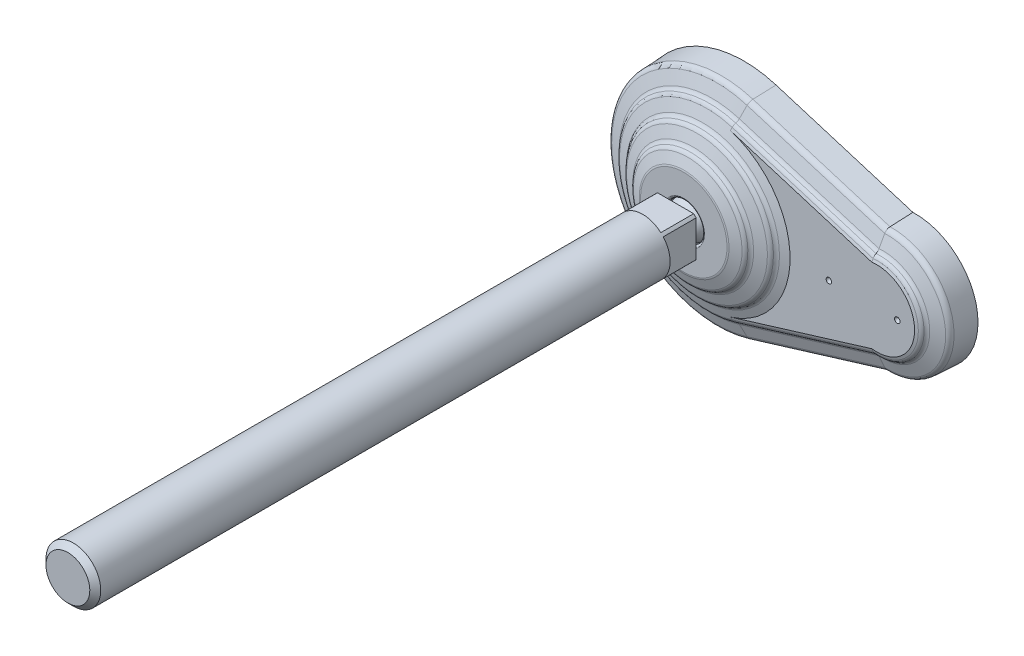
ISO-10303-21;
HEADER;
FILE_DESCRIPTION(('STEP AP214'),'2;1');
FILE_NAME('part.step','',(''),(''),'','','');
FILE_SCHEMA(('AUTOMOTIVE_DESIGN { 1 0 10303 214 1 1 1 1 }'));
ENDSEC;
DATA;
#1=APPLICATION_CONTEXT('core data for automotive mechanical design processes');
#2=APPLICATION_PROTOCOL_DEFINITION('international standard','automotive_design',2000,#1);
#3=PRODUCT_CONTEXT('',#1,'mechanical');
#4=PRODUCT('Part','Part','',(#3));
#5=PRODUCT_RELATED_PRODUCT_CATEGORY('part','',(#4));
#6=PRODUCT_DEFINITION_FORMATION('','',#4);
#7=PRODUCT_DEFINITION_CONTEXT('part definition',#1,'design');
#8=PRODUCT_DEFINITION('design','',#6,#7);
#9=PRODUCT_DEFINITION_SHAPE('','',#8);
#10=(LENGTH_UNIT() NAMED_UNIT(*) SI_UNIT(.MILLI.,.METRE.));
#11=(NAMED_UNIT(*) PLANE_ANGLE_UNIT() SI_UNIT($,.RADIAN.));
#12=(NAMED_UNIT(*) SI_UNIT($,.STERADIAN.) SOLID_ANGLE_UNIT());
#13=UNCERTAINTY_MEASURE_WITH_UNIT(LENGTH_MEASURE(1.E-05),#10,'distance_accuracy_value','');
#14=(GEOMETRIC_REPRESENTATION_CONTEXT(3) GLOBAL_UNCERTAINTY_ASSIGNED_CONTEXT((#13)) GLOBAL_UNIT_ASSIGNED_CONTEXT((#10,
#11,#12)) REPRESENTATION_CONTEXT('',''));
#15=CARTESIAN_POINT('',(0.,0.,0.));
#16=DIRECTION('',(0.,0.,1.));
#17=DIRECTION('',(1.,0.,0.));
#18=AXIS2_PLACEMENT_3D('',#15,#16,#17);
#19=CARTESIAN_POINT('',(0.,0.,39.));
#20=DIRECTION('',(0.,0.,1.));
#21=DIRECTION('',(-1.,0.,0.));
#22=AXIS2_PLACEMENT_3D('',#19,#20,#21);
#23=CYLINDRICAL_SURFACE('',#22,10.);
#24=CARTESIAN_POINT('',(0.,0.,247.));
#25=DIRECTION('',(0.,0.,1.));
#26=DIRECTION('',(-1.,0.,0.));
#27=AXIS2_PLACEMENT_3D('',#24,#25,#26);
#28=CIRCLE('',#27,10.);
#29=CARTESIAN_POINT('',(-10.,0.,247.));
#30=VERTEX_POINT('',#29);
#31=EDGE_CURVE('E9',#30,#30,#28,.F.);
#32=ORIENTED_EDGE('',*,*,#31,.T.);
#33=EDGE_LOOP('',(#32));
#34=FACE_BOUND('',#33,.T.);
#35=DIRECTION('',(0.,0.,1.));
#36=VECTOR('',#35,1.);
#37=CARTESIAN_POINT('',(-6.61437827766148,-7.5,39.));
#38=LINE('',#37,#36);
#39=CARTESIAN_POINT('',(-6.61437827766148,-7.5,39.));
#40=VERTEX_POINT('',#39);
#41=CARTESIAN_POINT('',(-6.61437827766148,-7.5,27.));
#42=VERTEX_POINT('',#41);
#43=EDGE_CURVE('E159',#40,#42,#38,.F.);
#44=ORIENTED_EDGE('',*,*,#43,.F.);
#45=CARTESIAN_POINT('',(0.,0.,39.));
#46=DIRECTION('',(0.,0.,1.));
#47=DIRECTION('',(0.,-1.,0.));
#48=AXIS2_PLACEMENT_3D('',#45,#46,#47);
#49=CIRCLE('',#48,10.);
#50=CARTESIAN_POINT('',(6.61437827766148,-7.5,39.));
#51=VERTEX_POINT('',#50);
#52=EDGE_CURVE('E805',#40,#51,#49,.T.);
#53=ORIENTED_EDGE('',*,*,#52,.T.);
#54=DIRECTION('',(0.,0.,1.));
#55=VECTOR('',#54,1.);
#56=CARTESIAN_POINT('',(6.61437827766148,-7.5,39.));
#57=LINE('',#56,#55);
#58=CARTESIAN_POINT('',(6.61437827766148,-7.5,27.));
#59=VERTEX_POINT('',#58);
#60=EDGE_CURVE('E224',#59,#51,#57,.T.);
#61=ORIENTED_EDGE('',*,*,#60,.F.);
#62=CARTESIAN_POINT('',(0.,0.,27.));
#63=DIRECTION('',(0.,0.,1.));
#64=DIRECTION('',(-1.,0.,0.));
#65=AXIS2_PLACEMENT_3D('',#62,#63,#64);
#66=CIRCLE('',#65,10.);
#67=CARTESIAN_POINT('',(7.5,-6.61437827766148,27.));
#68=VERTEX_POINT('',#67);
#69=EDGE_CURVE('E207',#59,#68,#66,.T.);
#70=ORIENTED_EDGE('',*,*,#69,.T.);
#71=DIRECTION('',(0.,0.,1.));
#72=VECTOR('',#71,1.);
#73=CARTESIAN_POINT('',(7.5,-6.61437827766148,39.));
#74=LINE('',#73,#72);
#75=CARTESIAN_POINT('',(7.5,-6.61437827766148,39.));
#76=VERTEX_POINT('',#75);
#77=EDGE_CURVE('E221',#76,#68,#74,.F.);
#78=ORIENTED_EDGE('',*,*,#77,.F.);
#79=CARTESIAN_POINT('',(7.5,6.61437827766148,39.));
#80=VERTEX_POINT('',#79);
#81=EDGE_CURVE('E301',#76,#80,#49,.T.);
#82=ORIENTED_EDGE('',*,*,#81,.T.);
#83=DIRECTION('',(0.,0.,1.));
#84=VECTOR('',#83,1.);
#85=CARTESIAN_POINT('',(7.5,6.61437827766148,39.));
#86=LINE('',#85,#84);
#87=CARTESIAN_POINT('',(7.5,6.61437827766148,27.));
#88=VERTEX_POINT('',#87);
#89=EDGE_CURVE('E266',#88,#80,#86,.T.);
#90=ORIENTED_EDGE('',*,*,#89,.F.);
#91=CARTESIAN_POINT('',(6.61437827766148,7.5,27.));
#92=VERTEX_POINT('',#91);
#93=EDGE_CURVE('E203',#88,#92,#66,.T.);
#94=ORIENTED_EDGE('',*,*,#93,.T.);
#95=DIRECTION('',(0.,0.,1.));
#96=VECTOR('',#95,1.);
#97=CARTESIAN_POINT('',(6.61437827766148,7.5,39.));
#98=LINE('',#97,#96);
#99=CARTESIAN_POINT('',(6.61437827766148,7.5,39.));
#100=VERTEX_POINT('',#99);
#101=EDGE_CURVE('E184',#100,#92,#98,.F.);
#102=ORIENTED_EDGE('',*,*,#101,.F.);
#103=CARTESIAN_POINT('',(-6.61437827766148,7.5,39.));
#104=VERTEX_POINT('',#103);
#105=EDGE_CURVE('E197',#100,#104,#49,.T.);
#106=ORIENTED_EDGE('',*,*,#105,.T.);
#107=DIRECTION('',(0.,0.,1.));
#108=VECTOR('',#107,1.);
#109=CARTESIAN_POINT('',(-6.61437827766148,7.5,39.));
#110=LINE('',#109,#108);
#111=CARTESIAN_POINT('',(-6.61437827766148,7.5,27.));
#112=VERTEX_POINT('',#111);
#113=EDGE_CURVE('E182',#112,#104,#110,.T.);
#114=ORIENTED_EDGE('',*,*,#113,.F.);
#115=CARTESIAN_POINT('',(-7.5,6.61437827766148,27.));
#116=VERTEX_POINT('',#115);
#117=EDGE_CURVE('E195',#112,#116,#66,.T.);
#118=ORIENTED_EDGE('',*,*,#117,.T.);
#119=DIRECTION('',(0.,0.,1.));
#120=VECTOR('',#119,1.);
#121=CARTESIAN_POINT('',(-7.5,6.61437827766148,39.));
#122=LINE('',#121,#120);
#123=CARTESIAN_POINT('',(-7.5,6.61437827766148,39.));
#124=VERTEX_POINT('',#123);
#125=EDGE_CURVE('E198',#124,#116,#122,.F.);
#126=ORIENTED_EDGE('',*,*,#125,.F.);
#127=CARTESIAN_POINT('',(-7.5,-6.61437827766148,39.));
#128=VERTEX_POINT('',#127);
#129=EDGE_CURVE('E806',#124,#128,#49,.T.);
#130=ORIENTED_EDGE('',*,*,#129,.T.);
#131=DIRECTION('',(0.,0.,1.));
#132=VECTOR('',#131,1.);
#133=CARTESIAN_POINT('',(-7.5,-6.61437827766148,39.));
#134=LINE('',#133,#132);
#135=CARTESIAN_POINT('',(-7.5,-6.61437827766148,27.));
#136=VERTEX_POINT('',#135);
#137=EDGE_CURVE('E204',#136,#128,#134,.T.);
#138=ORIENTED_EDGE('',*,*,#137,.F.);
#139=EDGE_CURVE('E206',#136,#42,#66,.T.);
#140=ORIENTED_EDGE('',*,*,#139,.T.);
#141=EDGE_LOOP('',(#44,#53,#61,#70,#78,#82,#90,#94,#102,#106,#114,#118,#126,#130,#138,#140));
#142=FACE_BOUND('',#141,.T.);
#143=ADVANCED_FACE('F15',(#34,#142),#23,.T.);
#144=CARTESIAN_POINT('',(-5.26544933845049,0.,27.));
#145=DIRECTION('',(0.,0.,1.));
#146=DIRECTION('',(-1.,0.,0.));
#147=AXIS2_PLACEMENT_3D('',#144,#145,#146);
#148=PLANE('',#147);
#149=DIRECTION('',(0.,-1.,0.));
#150=VECTOR('',#149,1.);
#151=CARTESIAN_POINT('',(-7.5,7.5,27.));
#152=LINE('',#151,#150);
#153=EDGE_CURVE('E32',#116,#136,#152,.T.);
#154=ORIENTED_EDGE('',*,*,#153,.F.);
#155=ORIENTED_EDGE('',*,*,#117,.F.);
#156=DIRECTION('',(-1.,0.,0.));
#157=VECTOR('',#156,1.);
#158=CARTESIAN_POINT('',(7.5,7.5,27.));
#159=LINE('',#158,#157);
#160=EDGE_CURVE('E177',#92,#112,#159,.T.);
#161=ORIENTED_EDGE('',*,*,#160,.F.);
#162=ORIENTED_EDGE('',*,*,#93,.F.);
#163=DIRECTION('',(0.,1.,0.));
#164=VECTOR('',#163,1.);
#165=CARTESIAN_POINT('',(7.5,-7.5,27.));
#166=LINE('',#165,#164);
#167=EDGE_CURVE('E189',#68,#88,#166,.T.);
#168=ORIENTED_EDGE('',*,*,#167,.F.);
#169=ORIENTED_EDGE('',*,*,#69,.F.);
#170=DIRECTION('',(1.,0.,0.));
#171=VECTOR('',#170,1.);
#172=CARTESIAN_POINT('',(-7.5,-7.5,27.));
#173=LINE('',#172,#171);
#174=EDGE_CURVE('E226',#42,#59,#173,.T.);
#175=ORIENTED_EDGE('',*,*,#174,.F.);
#176=ORIENTED_EDGE('',*,*,#139,.F.);
#177=EDGE_LOOP('',(#154,#155,#161,#162,#168,#169,#175,#176));
#178=FACE_BOUND('',#177,.T.);
#179=CARTESIAN_POINT('',(0.,0.,27.));
#180=DIRECTION('',(0.,0.,1.));
#181=DIRECTION('',(-1.,0.,0.));
#182=AXIS2_PLACEMENT_3D('',#179,#180,#181);
#183=CIRCLE('',#182,5.26544933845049);
#184=CARTESIAN_POINT('',(-5.26544933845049,0.,27.));
#185=VERTEX_POINT('',#184);
#186=EDGE_CURVE('E212',#185,#185,#183,.T.);
#187=ORIENTED_EDGE('',*,*,#186,.T.);
#188=EDGE_LOOP('',(#187));
#189=FACE_BOUND('',#188,.T.);
#190=ADVANCED_FACE('F200',(#178,#189),#148,.F.);
#191=CARTESIAN_POINT('',(0.,0.,20.6509999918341));
#192=DIRECTION('',(0.,0.,1.));
#193=DIRECTION('',(-1.,0.,0.));
#194=AXIS2_PLACEMENT_3D('',#191,#192,#193);
#195=DEGENERATE_TOROIDAL_SURFACE('',#194,0.000333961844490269,6.829,.T.);
#196=CARTESIAN_POINT('',(0.,0.,21.794));
#197=DIRECTION('',(0.,0.,-1.));
#198=DIRECTION('',(1.,0.,0.));
#199=AXIS2_PLACEMENT_3D('',#196,#197,#198);
#200=CIRCLE('',#199,6.733);
#201=CARTESIAN_POINT('',(6.733,0.,21.794));
#202=VERTEX_POINT('',#201);
#203=EDGE_CURVE('E273',#202,#202,#200,.T.);
#204=ORIENTED_EDGE('',*,*,#203,.F.);
#205=EDGE_LOOP('',(#204));
#206=FACE_BOUND('',#205,.T.);
#207=CARTESIAN_POINT('',(0.,0.,25.));
#208=DIRECTION('',(0.,0.,1.));
#209=DIRECTION('',(-1.,0.,0.));
#210=AXIS2_PLACEMENT_3D('',#207,#208,#209);
#211=CIRCLE('',#210,5.26544933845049);
#212=CARTESIAN_POINT('',(-5.26544933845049,0.,25.));
#213=VERTEX_POINT('',#212);
#214=EDGE_CURVE('E214',#213,#213,#211,.T.);
#215=ORIENTED_EDGE('',*,*,#214,.F.);
#216=EDGE_LOOP('',(#215));
#217=FACE_BOUND('',#216,.T.);
#218=ADVANCED_FACE('F512',(#206,#217),#195,.T.);
#219=CARTESIAN_POINT('',(0.,0.,39.));
#220=DIRECTION('',(0.,0.,1.));
#221=DIRECTION('',(-1.,0.,0.));
#222=AXIS2_PLACEMENT_3D('',#219,#220,#221);
#223=CYLINDRICAL_SURFACE('',#222,5.26544933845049);
#224=ORIENTED_EDGE('',*,*,#186,.F.);
#225=EDGE_LOOP('',(#224));
#226=FACE_BOUND('',#225,.T.);
#227=ORIENTED_EDGE('',*,*,#214,.T.);
#228=EDGE_LOOP('',(#227));
#229=FACE_BOUND('',#228,.T.);
#230=ADVANCED_FACE('F780',(#226,#229),#223,.T.);
#231=CARTESIAN_POINT('',(-7.5,-7.5,27.));
#232=DIRECTION('',(0.,-1.,0.));
#233=DIRECTION('',(1.,0.,0.));
#234=AXIS2_PLACEMENT_3D('',#231,#232,#233);
#235=PLANE('',#234);
#236=ORIENTED_EDGE('',*,*,#60,.T.);
#237=DIRECTION('',(-1.,0.,0.));
#238=VECTOR('',#237,1.);
#239=CARTESIAN_POINT('',(-10.,-7.5,39.));
#240=LINE('',#239,#238);
#241=EDGE_CURVE('E238',#51,#40,#240,.T.);
#242=ORIENTED_EDGE('',*,*,#241,.T.);
#243=ORIENTED_EDGE('',*,*,#43,.T.);
#244=ORIENTED_EDGE('',*,*,#174,.T.);
#245=EDGE_LOOP('',(#236,#242,#243,#244));
#246=FACE_BOUND('',#245,.T.);
#247=ADVANCED_FACE('F778',(#246),#235,.T.);
#248=CARTESIAN_POINT('',(7.5,-7.5,27.));
#249=DIRECTION('',(1.,0.,0.));
#250=DIRECTION('',(0.,1.,0.));
#251=AXIS2_PLACEMENT_3D('',#248,#249,#250);
#252=PLANE('',#251);
#253=ORIENTED_EDGE('',*,*,#89,.T.);
#254=DIRECTION('',(0.,-1.,0.));
#255=VECTOR('',#254,1.);
#256=CARTESIAN_POINT('',(7.5,0.,39.));
#257=LINE('',#256,#255);
#258=EDGE_CURVE('E245',#80,#76,#257,.T.);
#259=ORIENTED_EDGE('',*,*,#258,.T.);
#260=ORIENTED_EDGE('',*,*,#77,.T.);
#261=ORIENTED_EDGE('',*,*,#167,.T.);
#262=EDGE_LOOP('',(#253,#259,#260,#261));
#263=FACE_BOUND('',#262,.T.);
#264=ADVANCED_FACE('F774',(#263),#252,.T.);
#265=CARTESIAN_POINT('',(7.5,7.5,27.));
#266=DIRECTION('',(0.,1.,0.));
#267=DIRECTION('',(-1.,0.,0.));
#268=AXIS2_PLACEMENT_3D('',#265,#266,#267);
#269=PLANE('',#268);
#270=ORIENTED_EDGE('',*,*,#113,.T.);
#271=DIRECTION('',(1.,0.,0.));
#272=VECTOR('',#271,1.);
#273=CARTESIAN_POINT('',(-10.,7.5,39.));
#274=LINE('',#273,#272);
#275=EDGE_CURVE('E249',#104,#100,#274,.T.);
#276=ORIENTED_EDGE('',*,*,#275,.T.);
#277=ORIENTED_EDGE('',*,*,#101,.T.);
#278=ORIENTED_EDGE('',*,*,#160,.T.);
#279=EDGE_LOOP('',(#270,#276,#277,#278));
#280=FACE_BOUND('',#279,.T.);
#281=ADVANCED_FACE('F179',(#280),#269,.T.);
#282=CARTESIAN_POINT('',(-7.5,7.5,27.));
#283=DIRECTION('',(-1.,0.,0.));
#284=DIRECTION('',(0.,-1.,0.));
#285=AXIS2_PLACEMENT_3D('',#282,#283,#284);
#286=PLANE('',#285);
#287=ORIENTED_EDGE('',*,*,#137,.T.);
#288=DIRECTION('',(0.,1.,0.));
#289=VECTOR('',#288,1.);
#290=CARTESIAN_POINT('',(-7.5,0.,39.));
#291=LINE('',#290,#289);
#292=EDGE_CURVE('E262',#128,#124,#291,.T.);
#293=ORIENTED_EDGE('',*,*,#292,.T.);
#294=ORIENTED_EDGE('',*,*,#125,.T.);
#295=ORIENTED_EDGE('',*,*,#153,.T.);
#296=EDGE_LOOP('',(#287,#293,#294,#295));
#297=FACE_BOUND('',#296,.T.);
#298=ADVANCED_FACE('F754',(#297),#286,.T.);
#299=CARTESIAN_POINT('',(0.,0.,0.));
#300=DIRECTION('',(0.,0.,1.));
#301=DIRECTION('',(0.,-1.,0.));
#302=AXIS2_PLACEMENT_3D('',#299,#300,#301);
#303=PLANE('',#302);
#304=DIRECTION('',(-0.951485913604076,0.307692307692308,0.));
#305=VECTOR('',#304,1.);
#306=CARTESIAN_POINT('',(69.9230769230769,15.2237746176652,0.));
#307=LINE('',#306,#305);
#308=CARTESIAN_POINT('',(69.9230769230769,15.2237746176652,0.));
#309=VERTEX_POINT('',#308);
#310=CARTESIAN_POINT('',(11.0769230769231,34.2534928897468,0.));
#311=VERTEX_POINT('',#310);
#312=EDGE_CURVE('E285',#309,#311,#307,.T.);
#313=ORIENTED_EDGE('',*,*,#312,.F.);
#314=CARTESIAN_POINT('',(65.,0.,0.));
#315=DIRECTION('',(0.,0.,1.));
#316=DIRECTION('',(1.,0.,0.));
#317=AXIS2_PLACEMENT_3D('',#314,#315,#316);
#318=CIRCLE('',#317,16.);
#319=CARTESIAN_POINT('',(69.9230769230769,-15.2237746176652,0.));
#320=VERTEX_POINT('',#319);
#321=EDGE_CURVE('E295',#320,#309,#318,.T.);
#322=ORIENTED_EDGE('',*,*,#321,.F.);
#323=DIRECTION('',(0.951485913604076,0.307692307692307,0.));
#324=VECTOR('',#323,1.);
#325=CARTESIAN_POINT('',(11.0769230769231,-34.2534928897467,0.));
#326=LINE('',#325,#324);
#327=CARTESIAN_POINT('',(11.0769230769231,-34.2534928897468,0.));
#328=VERTEX_POINT('',#327);
#329=EDGE_CURVE('E292',#328,#320,#326,.T.);
#330=ORIENTED_EDGE('',*,*,#329,.F.);
#331=CARTESIAN_POINT('',(0.,0.,0.));
#332=DIRECTION('',(0.,0.,1.));
#333=DIRECTION('',(1.,0.,0.));
#334=AXIS2_PLACEMENT_3D('',#331,#332,#333);
#335=CIRCLE('',#334,36.);
#336=EDGE_CURVE('E288',#311,#328,#335,.T.);
#337=ORIENTED_EDGE('',*,*,#336,.F.);
#338=EDGE_LOOP('',(#313,#322,#330,#337));
#339=FACE_BOUND('',#338,.T.);
#340=ADVANCED_FACE('F514',(#339),#303,.F.);
#341=CARTESIAN_POINT('',(11.0769230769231,-34.2534928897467,0.));
#342=DIRECTION('',(0.307692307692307,-0.951485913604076,0.));
#343=DIRECTION('',(0.951485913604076,0.307692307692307,0.));
#344=AXIS2_PLACEMENT_3D('',#341,#342,#343);
#345=PLANE('',#344);
#346=DIRECTION('',(0.951485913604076,0.307692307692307,0.));
#347=VECTOR('',#346,1.);
#348=CARTESIAN_POINT('',(11.0769230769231,-34.2534928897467,2.));
#349=LINE('',#348,#347);
#350=CARTESIAN_POINT('',(11.0769230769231,-34.2534928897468,2.));
#351=VERTEX_POINT('',#350);
#352=CARTESIAN_POINT('',(69.9230769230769,-15.2237746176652,2.));
#353=VERTEX_POINT('',#352);
#354=EDGE_CURVE('E304',#351,#353,#349,.T.);
#355=ORIENTED_EDGE('',*,*,#354,.F.);
#356=DIRECTION('',(0.,0.,1.));
#357=VECTOR('',#356,1.);
#358=CARTESIAN_POINT('',(11.0769230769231,-34.2534928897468,0.));
#359=LINE('',#358,#357);
#360=EDGE_CURVE('E312',#328,#351,#359,.T.);
#361=ORIENTED_EDGE('',*,*,#360,.F.);
#362=ORIENTED_EDGE('',*,*,#329,.T.);
#363=DIRECTION('',(0.,0.,1.));
#364=VECTOR('',#363,1.);
#365=CARTESIAN_POINT('',(69.9230769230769,-15.2237746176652,0.));
#366=LINE('',#365,#364);
#367=EDGE_CURVE('E310',#320,#353,#366,.T.);
#368=ORIENTED_EDGE('',*,*,#367,.T.);
#369=EDGE_LOOP('',(#355,#361,#362,#368));
#370=FACE_BOUND('',#369,.T.);
#371=ADVANCED_FACE('F771',(#370),#345,.T.);
#372=CARTESIAN_POINT('',(0.,0.,0.));
#373=DIRECTION('',(0.,0.,1.));
#374=DIRECTION('',(0.,-1.,0.));
#375=AXIS2_PLACEMENT_3D('',#372,#373,#374);
#376=CYLINDRICAL_SURFACE('',#375,36.);
#377=CARTESIAN_POINT('',(0.,0.,2.));
#378=DIRECTION('',(0.,0.,1.));
#379=DIRECTION('',(1.,0.,0.));
#380=AXIS2_PLACEMENT_3D('',#377,#378,#379);
#381=CIRCLE('',#380,36.);
#382=CARTESIAN_POINT('',(11.0769230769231,34.2534928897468,2.));
#383=VERTEX_POINT('',#382);
#384=EDGE_CURVE('E300',#383,#351,#381,.T.);
#385=ORIENTED_EDGE('',*,*,#384,.F.);
#386=DIRECTION('',(0.,0.,1.));
#387=VECTOR('',#386,1.);
#388=CARTESIAN_POINT('',(11.0769230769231,34.2534928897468,0.));
#389=LINE('',#388,#387);
#390=EDGE_CURVE('E314',#311,#383,#389,.T.);
#391=ORIENTED_EDGE('',*,*,#390,.F.);
#392=ORIENTED_EDGE('',*,*,#336,.T.);
#393=ORIENTED_EDGE('',*,*,#360,.T.);
#394=EDGE_LOOP('',(#385,#391,#392,#393));
#395=FACE_BOUND('',#394,.T.);
#396=ADVANCED_FACE('F1138',(#395),#376,.T.);
#397=CARTESIAN_POINT('',(69.9230769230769,15.2237746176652,0.));
#398=DIRECTION('',(0.307692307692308,0.951485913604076,0.));
#399=DIRECTION('',(-0.951485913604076,0.307692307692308,0.));
#400=AXIS2_PLACEMENT_3D('',#397,#398,#399);
#401=PLANE('',#400);
#402=DIRECTION('',(-0.951485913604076,0.307692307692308,0.));
#403=VECTOR('',#402,1.);
#404=CARTESIAN_POINT('',(69.9230769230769,15.2237746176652,2.));
#405=LINE('',#404,#403);
#406=CARTESIAN_POINT('',(69.9230769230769,15.2237746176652,2.));
#407=VERTEX_POINT('',#406);
#408=EDGE_CURVE('E150',#407,#383,#405,.T.);
#409=ORIENTED_EDGE('',*,*,#408,.F.);
#410=DIRECTION('',(0.,0.,1.));
#411=VECTOR('',#410,1.);
#412=CARTESIAN_POINT('',(69.9230769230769,15.2237746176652,0.));
#413=LINE('',#412,#411);
#414=EDGE_CURVE('E298',#309,#407,#413,.T.);
#415=ORIENTED_EDGE('',*,*,#414,.F.);
#416=ORIENTED_EDGE('',*,*,#312,.T.);
#417=ORIENTED_EDGE('',*,*,#390,.T.);
#418=EDGE_LOOP('',(#409,#415,#416,#417));
#419=FACE_BOUND('',#418,.T.);
#420=ADVANCED_FACE('F538',(#419),#401,.T.);
#421=CARTESIAN_POINT('',(65.,0.,0.));
#422=DIRECTION('',(0.,0.,1.));
#423=DIRECTION('',(0.,-1.,0.));
#424=AXIS2_PLACEMENT_3D('',#421,#422,#423);
#425=CYLINDRICAL_SURFACE('',#424,16.);
#426=CARTESIAN_POINT('',(65.,0.,2.));
#427=DIRECTION('',(0.,0.,1.));
#428=DIRECTION('',(1.,0.,0.));
#429=AXIS2_PLACEMENT_3D('',#426,#427,#428);
#430=CIRCLE('',#429,16.);
#431=EDGE_CURVE('E289',#353,#407,#430,.T.);
#432=ORIENTED_EDGE('',*,*,#431,.F.);
#433=ORIENTED_EDGE('',*,*,#367,.F.);
#434=ORIENTED_EDGE('',*,*,#321,.T.);
#435=ORIENTED_EDGE('',*,*,#414,.T.);
#436=EDGE_LOOP('',(#432,#433,#434,#435));
#437=FACE_BOUND('',#436,.T.);
#438=ADVANCED_FACE('F523',(#437),#425,.T.);
#439=CARTESIAN_POINT('',(62.5,0.,2.));
#440=DIRECTION('',(0.,0.,-1.));
#441=DIRECTION('',(0.,1.,0.));
#442=AXIS2_PLACEMENT_3D('',#439,#440,#441);
#443=CONICAL_SURFACE('',#442,22.9787234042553,0.0523365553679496);
#444=CARTESIAN_POINT('',(62.5,0.,10.3041173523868));
#445=DIRECTION('',(0.,0.,1.));
#446=DIRECTION('',(0.,-1.,0.));
#447=AXIS2_PLACEMENT_3D('',#444,#445,#446);
#448=CIRCLE('',#447,22.5437172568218);
#449=CARTESIAN_POINT('',(61.6407011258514,-22.5273343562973,10.3041173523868));
#450=VERTEX_POINT('',#449);
#451=CARTESIAN_POINT('',(61.6407011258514,22.5273343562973,10.3041173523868));
#452=VERTEX_POINT('',#451);
#453=EDGE_CURVE('E344',#450,#452,#448,.T.);
#454=ORIENTED_EDGE('',*,*,#453,.F.);
#455=CARTESIAN_POINT('',(61.6406997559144,-22.5273238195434,10.3043173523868));
#456=CARTESIAN_POINT('',(61.6501805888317,-22.600242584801,8.92023165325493));
#457=CARTESIAN_POINT('',(61.6596900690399,-22.6731526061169,7.53614569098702));
#458=CARTESIAN_POINT('',(61.6787663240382,-22.8189551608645,4.76797324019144));
#459=CARTESIAN_POINT('',(61.6883330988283,-22.8918476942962,3.38388675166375));
#460=CARTESIAN_POINT('',(61.6979285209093,-22.9647314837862,1.9998));
#461=B_SPLINE_CURVE_WITH_KNOTS('',3,(#455,#456,#457,#458,#459,#460),.UNSPECIFIED.,.F.,.F.,(4,2,
4),(0.,4.15811282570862,8.31622565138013),.UNSPECIFIED.);
#462=CARTESIAN_POINT('',(61.697927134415,-22.9647209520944,2.));
#463=VERTEX_POINT('',#462);
#464=EDGE_CURVE('E651',#450,#463,#461,.T.);
#465=ORIENTED_EDGE('',*,*,#464,.T.);
#466=CARTESIAN_POINT('',(62.5,0.,2.));
#467=DIRECTION('',(0.,0.,1.));
#468=DIRECTION('',(0.,-1.,0.));
#469=AXIS2_PLACEMENT_3D('',#466,#467,#468);
#470=CIRCLE('',#469,22.9787234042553);
#471=CARTESIAN_POINT('',(61.6979271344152,22.9647209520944,2.));
#472=VERTEX_POINT('',#471);
#473=EDGE_CURVE('E346',#463,#472,#470,.T.);
#474=ORIENTED_EDGE('',*,*,#473,.T.);
#475=CARTESIAN_POINT('',(61.6979285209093,22.9647314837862,1.9998));
#476=CARTESIAN_POINT('',(61.6883330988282,22.8918476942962,3.38388675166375));
#477=CARTESIAN_POINT('',(61.6787663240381,22.8189551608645,4.76797324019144));
#478=CARTESIAN_POINT('',(61.6596900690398,22.6731526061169,7.53614569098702));
#479=CARTESIAN_POINT('',(61.6501805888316,22.600242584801,8.92023165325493));
#480=CARTESIAN_POINT('',(61.6406997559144,22.5273238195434,10.3043173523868));
#481=B_SPLINE_CURVE_WITH_KNOTS('',3,(#475,#476,#477,#478,#479,#480),.UNSPECIFIED.,.F.,.F.,(4,2,
4),(0.,4.15811282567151,8.31622565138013),.UNSPECIFIED.);
#482=EDGE_CURVE('E697',#472,#452,#481,.T.);
#483=ORIENTED_EDGE('',*,*,#482,.T.);
#484=EDGE_LOOP('',(#454,#465,#474,#483));
#485=FACE_BOUND('',#484,.T.);
#486=ADVANCED_FACE('F517',(#485),#443,.T.);
#487=CARTESIAN_POINT('',(64.1644462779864,-21.755748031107,10.3041173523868));
#488=DIRECTION('',(-0.291971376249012,0.9549953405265,-0.0523126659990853));
#489=DIRECTION('',(-0.956304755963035,-0.292371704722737,0.));
#490=AXIS2_PLACEMENT_3D('',#487,#488,#489);
#491=PLANE('',#490);
#492=ORIENTED_EDGE('',*,*,#464,.F.);
#493=DIRECTION('',(-0.956304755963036,-0.292371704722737,0.));
#494=VECTOR('',#493,1.);
#495=CARTESIAN_POINT('',(64.1644462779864,-21.755748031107,10.3041173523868));
#496=LINE('',#495,#494);
#497=CARTESIAN_POINT('',(11.5676847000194,-37.8361917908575,10.3041173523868));
#498=VERTEX_POINT('',#497);
#499=EDGE_CURVE('E600',#450,#498,#496,.T.);
#500=ORIENTED_EDGE('',*,*,#499,.T.);
#501=DIRECTION('',(-0.0152947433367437,0.050026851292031,0.998630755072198));
#502=VECTOR('',#501,1.);
#503=CARTESIAN_POINT('',(11.6948681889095,-38.2521902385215,2.));
#504=LINE('',#503,#502);
#505=CARTESIAN_POINT('',(11.6948681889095,-38.2521902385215,2.));
#506=VERTEX_POINT('',#505);
#507=EDGE_CURVE('E606',#506,#498,#504,.T.);
#508=ORIENTED_EDGE('',*,*,#507,.F.);
#509=DIRECTION('',(-0.956304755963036,-0.292371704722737,0.));
#510=VECTOR('',#509,1.);
#511=CARTESIAN_POINT('',(64.2916297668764,-22.1717464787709,2.));
#512=LINE('',#511,#510);
#513=EDGE_CURVE('E144',#463,#506,#512,.T.);
#514=ORIENTED_EDGE('',*,*,#513,.F.);
#515=EDGE_LOOP('',(#492,#500,#508,#514));
#516=FACE_BOUND('',#515,.T.);
#517=ADVANCED_FACE('F508',(#516),#491,.F.);
#518=CARTESIAN_POINT('',(0.,0.,2.));
#519=DIRECTION('',(0.,0.,1.));
#520=DIRECTION('',(-1.,0.,0.));
#521=AXIS2_PLACEMENT_3D('',#518,#519,#520);
#522=PLANE('',#521);
#523=DIRECTION('',(-0.956304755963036,0.292371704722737,0.));
#524=VECTOR('',#523,1.);
#525=CARTESIAN_POINT('',(64.2916297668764,22.1717464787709,2.));
#526=LINE('',#525,#524);
#527=CARTESIAN_POINT('',(11.6948681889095,38.2521902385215,2.));
#528=VERTEX_POINT('',#527);
#529=EDGE_CURVE('E653',#472,#528,#526,.T.);
#530=ORIENTED_EDGE('',*,*,#529,.F.);
#531=ORIENTED_EDGE('',*,*,#473,.F.);
#532=ORIENTED_EDGE('',*,*,#513,.T.);
#533=CARTESIAN_POINT('',(0.,0.,2.));
#534=DIRECTION('',(0.,0.,1.));
#535=DIRECTION('',(-1.,0.,0.));
#536=AXIS2_PLACEMENT_3D('',#533,#534,#535);
#537=CIRCLE('',#536,40.);
#538=EDGE_CURVE('E389',#528,#506,#537,.T.);
#539=ORIENTED_EDGE('',*,*,#538,.F.);
#540=EDGE_LOOP('',(#530,#531,#532,#539));
#541=FACE_BOUND('',#540,.T.);
#542=ORIENTED_EDGE('',*,*,#431,.T.);
#543=ORIENTED_EDGE('',*,*,#408,.T.);
#544=ORIENTED_EDGE('',*,*,#384,.T.);
#545=ORIENTED_EDGE('',*,*,#354,.T.);
#546=EDGE_LOOP('',(#542,#543,#544,#545));
#547=FACE_BOUND('',#546,.T.);
#548=ADVANCED_FACE('F398',(#541,#547),#522,.F.);
#549=CARTESIAN_POINT('',(64.2916297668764,22.1717464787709,2.));
#550=DIRECTION('',(-0.291971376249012,-0.9549953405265,-0.0523126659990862));
#551=DIRECTION('',(0.956304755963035,-0.292371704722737,0.));
#552=AXIS2_PLACEMENT_3D('',#549,#550,#551);
#553=PLANE('',#552);
#554=ORIENTED_EDGE('',*,*,#482,.F.);
#555=ORIENTED_EDGE('',*,*,#529,.T.);
#556=DIRECTION('',(-0.0152947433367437,-0.050026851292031,0.998630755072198));
#557=VECTOR('',#556,1.);
#558=CARTESIAN_POINT('',(11.6948681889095,38.2521902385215,2.));
#559=LINE('',#558,#557);
#560=CARTESIAN_POINT('',(11.5676847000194,37.8361917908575,10.3041173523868));
#561=VERTEX_POINT('',#560);
#562=EDGE_CURVE('E620',#528,#561,#559,.T.);
#563=ORIENTED_EDGE('',*,*,#562,.T.);
#564=DIRECTION('',(-0.956304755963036,0.292371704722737,0.));
#565=VECTOR('',#564,1.);
#566=CARTESIAN_POINT('',(64.1644462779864,21.755748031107,10.3041173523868));
#567=LINE('',#566,#565);
#568=EDGE_CURVE('E654',#452,#561,#567,.T.);
#569=ORIENTED_EDGE('',*,*,#568,.F.);
#570=EDGE_LOOP('',(#554,#555,#563,#569));
#571=FACE_BOUND('',#570,.T.);
#572=ADVANCED_FACE('F478',(#571),#553,.F.);
#573=CARTESIAN_POINT('',(62.5,0.,10.1991258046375));
#574=DIRECTION('',(0.,0.,1.));
#575=DIRECTION('',(0.,-1.,0.));
#576=AXIS2_PLACEMENT_3D('',#573,#574,#575);
#577=TOROIDAL_SURFACE('',#576,20.5394653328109,2.007);
#578=CARTESIAN_POINT('',(61.6407233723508,-22.5275054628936,10.0974340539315));
#579=CARTESIAN_POINT('',(61.6409510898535,-22.5292569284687,10.1317993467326));
#580=CARTESIAN_POINT('',(61.6410635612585,-22.5301219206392,10.1661964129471));
#581=CARTESIAN_POINT('',(61.6410572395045,-22.5300732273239,10.235045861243));
#582=CARTESIAN_POINT('',(61.6409380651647,-22.5291566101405,10.2694982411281));
#583=CARTESIAN_POINT('',(61.6399396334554,-22.5214778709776,10.4153785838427));
#584=CARTESIAN_POINT('',(61.6379561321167,-22.5062239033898,10.526490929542));
#585=CARTESIAN_POINT('',(61.6316126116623,-22.4573679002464,10.7446232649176));
#586=CARTESIAN_POINT('',(61.6272490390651,-22.4237384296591,10.8516368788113));
#587=CARTESIAN_POINT('',(61.6163034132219,-22.339189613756,11.058357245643));
#588=CARTESIAN_POINT('',(61.6097238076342,-22.2882893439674,11.1580719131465));
#589=CARTESIAN_POINT('',(61.5945702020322,-22.1707054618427,11.3475467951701));
#590=CARTESIAN_POINT('',(61.5859960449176,-22.1040206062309,11.4373062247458));
#591=CARTESIAN_POINT('',(61.5670698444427,-21.9562760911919,11.6050783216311));
#592=CARTESIAN_POINT('',(61.5567047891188,-21.8751110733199,11.6829965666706));
#593=CARTESIAN_POINT('',(61.5345911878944,-21.7011851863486,11.8241014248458));
#594=CARTESIAN_POINT('',(61.5228449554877,-21.6084436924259,11.8873121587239));
#595=CARTESIAN_POINT('',(61.5046129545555,-21.4637836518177,11.9692866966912));
#596=CARTESIAN_POINT('',(61.4985079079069,-21.4152343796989,11.9942523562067));
#597=CARTESIAN_POINT('',(61.4860940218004,-21.3162718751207,12.0401972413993));
#598=CARTESIAN_POINT('',(61.4797850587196,-21.2658575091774,12.0611739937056));
#599=CARTESIAN_POINT('',(61.4596293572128,-21.1043762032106,12.1208327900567));
#600=CARTESIAN_POINT('',(61.4454888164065,-20.9904779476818,12.1519983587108));
#601=CARTESIAN_POINT('',(61.4169436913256,-20.7591475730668,12.1941665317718));
#602=CARTESIAN_POINT('',(61.4025394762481,-20.6417202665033,12.2051954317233));
#603=CARTESIAN_POINT('',(61.3876252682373,-20.5193667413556,12.2061070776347));
#604=CARTESIAN_POINT('',(61.3870090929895,-20.5143103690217,12.2061258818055));
#605=CARTESIAN_POINT('',(61.3863931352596,-20.5092543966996,12.2061258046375));
#606=B_SPLINE_CURVE_WITH_KNOTS('',3,(#578,#579,#580,#581,#582,#583,#584,#585,#586,#587,#588,
#589,#590,#591,#592,#593,#594,#595,#596,#597,#598,#599,#600,#601,#602,#603,#604,#605),
.UNSPECIFIED.,.F.,.F.,(4,2,2,2,2,2,2,2,2,2,2,2,2,4),(0.,0.103191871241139,0.20655369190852,
0.541275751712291,0.87649892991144,1.21135305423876,1.54623356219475,1.8836582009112,
2.22052549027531,2.38517216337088,2.54992059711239,2.9048600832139,3.25933573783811,
3.2746170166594),.UNSPECIFIED.);
#607=CARTESIAN_POINT('',(61.4734629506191,-21.2152067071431,12.0798866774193));
#608=VERTEX_POINT('',#607);
#609=EDGE_CURVE('E1245',#450,#608,#606,.T.);
#610=ORIENTED_EDGE('',*,*,#609,.F.);
#611=ORIENTED_EDGE('',*,*,#453,.T.);
#612=CARTESIAN_POINT('',(61.3863931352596,20.5092543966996,12.2061258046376));
#613=CARTESIAN_POINT('',(61.3870091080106,20.5143104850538,12.2061258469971));
#614=CARTESIAN_POINT('',(61.3876252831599,20.5193668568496,12.206107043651));
#615=CARTESIAN_POINT('',(61.3988855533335,20.6117442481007,12.2054193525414));
#616=CARTESIAN_POINT('',(61.4095840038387,20.6991031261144,12.1991511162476));
#617=CARTESIAN_POINT('',(61.4308936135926,20.8723273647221,12.1754412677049));
#618=CARTESIAN_POINT('',(61.4415047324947,20.9581920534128,12.1579947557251));
#619=CARTESIAN_POINT('',(61.4555813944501,21.0716202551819,12.1272225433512));
#620=CARTESIAN_POINT('',(61.4591730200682,21.1005182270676,12.1186877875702));
#621=CARTESIAN_POINT('',(61.4663157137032,21.1579059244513,12.1003430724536));
#622=CARTESIAN_POINT('',(61.4698667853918,21.1863956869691,12.090533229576));
#623=CARTESIAN_POINT('',(61.4866782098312,21.3210820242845,12.0407628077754));
#624=CARTESIAN_POINT('',(61.4996430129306,21.4243838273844,11.9924168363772));
#625=CARTESIAN_POINT('',(61.5245148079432,21.6216549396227,11.8789198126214));
#626=CARTESIAN_POINT('',(61.5364193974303,21.7156031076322,11.8137318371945));
#627=CARTESIAN_POINT('',(61.5587594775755,21.8912250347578,11.6683429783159));
#628=CARTESIAN_POINT('',(61.5691956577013,21.9729045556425,11.5881491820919));
#629=CARTESIAN_POINT('',(61.5882470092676,22.1215501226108,11.4149543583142));
#630=CARTESIAN_POINT('',(61.5968625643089,22.1885192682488,11.3219560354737));
#631=CARTESIAN_POINT('',(61.6119005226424,22.3051440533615,11.1267480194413));
#632=CARTESIAN_POINT('',(61.6183432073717,22.3549598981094,11.0246354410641));
#633=CARTESIAN_POINT('',(61.6289130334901,22.4365717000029,10.8134345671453));
#634=CARTESIAN_POINT('',(61.6330436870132,22.4683949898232,10.704357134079));
#635=CARTESIAN_POINT('',(61.6371976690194,22.5003783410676,10.5457196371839));
#636=CARTESIAN_POINT('',(61.6382205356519,22.5082502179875,10.4976293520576));
#637=CARTESIAN_POINT('',(61.639806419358,22.5204527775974,10.4010313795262));
#638=CARTESIAN_POINT('',(61.6403698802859,22.52478687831,10.3525241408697));
#639=CARTESIAN_POINT('',(61.6411729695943,22.5309631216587,10.2351641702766));
#640=CARTESIAN_POINT('',(61.641181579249,22.5310278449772,10.1662118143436));
#641=CARTESIAN_POINT('',(61.6407233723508,22.5275054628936,10.0974340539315));
#642=B_SPLINE_CURVE_WITH_KNOTS('',3,(#612,#613,#614,#615,#616,#617,#618,#619,#620,#621,#622,
#623,#624,#625,#626,#627,#628,#629,#630,#631,#632,#633,#634,#635,#636,#637,#638,#639,#640,#641),
.UNSPECIFIED.,.F.,.F.,(4,2,2,2,2,2,2,2,2,2,2,2,2,2,4),(0.,0.0152812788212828,0.279174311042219,
0.543183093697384,0.634194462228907,0.725197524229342,1.06775959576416,1.41107914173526,
1.75423694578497,2.09732237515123,2.43711059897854,2.77638125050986,2.92250118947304,
3.06847978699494,3.27496314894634),.UNSPECIFIED.);
#643=CARTESIAN_POINT('',(61.4734629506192,21.2152067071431,12.0798866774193));
#644=VERTEX_POINT('',#643);
#645=EDGE_CURVE('E467',#644,#452,#642,.T.);
#646=ORIENTED_EDGE('',*,*,#645,.F.);
#647=CARTESIAN_POINT('',(62.5,0.,12.0798866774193));
#648=DIRECTION('',(0.,0.,1.));
#649=DIRECTION('',(0.,-1.,0.));
#650=AXIS2_PLACEMENT_3D('',#647,#648,#649);
#651=CIRCLE('',#650,21.2400276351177);
#652=EDGE_CURVE('E342',#608,#644,#651,.T.);
#653=ORIENTED_EDGE('',*,*,#652,.F.);
#654=EDGE_LOOP('',(#610,#611,#646,#653));
#655=FACE_BOUND('',#654,.T.);
#656=ADVANCED_FACE('F449',(#655),#577,.T.);
#657=CARTESIAN_POINT('',(63.5784597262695,-19.8390723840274,10.1991258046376));
#658=DIRECTION('',(-0.956304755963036,-0.292371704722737,0.));
#659=DIRECTION('',(0.292371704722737,-0.956304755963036,0.));
#660=AXIS2_PLACEMENT_3D('',#657,#658,#659);
#661=CYLINDRICAL_SURFACE('',#660,2.00699999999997);
#662=ORIENTED_EDGE('',*,*,#499,.F.);
#663=ORIENTED_EDGE('',*,*,#609,.T.);
#664=DIRECTION('',(-0.956304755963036,-0.292371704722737,0.));
#665=VECTOR('',#664,1.);
#666=CARTESIAN_POINT('',(63.7832843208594,-20.5090234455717,12.0798866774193));
#667=LINE('',#666,#665);
#668=CARTESIAN_POINT('',(11.1865227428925,-36.5894672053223,12.0798866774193));
#669=VERTEX_POINT('',#668);
#670=EDGE_CURVE('E597',#608,#669,#667,.T.);
#671=ORIENTED_EDGE('',*,*,#670,.T.);
#672=CARTESIAN_POINT('',(10.9816981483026,-35.9195161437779,10.1991258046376));
#673=DIRECTION('',(0.956304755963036,0.292371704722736,0.));
#674=DIRECTION('',(-0.292371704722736,0.956304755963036,0.));
#675=AXIS2_PLACEMENT_3D('',#672,#673,#674);
#676=CIRCLE('',#675,2.007);
#677=EDGE_CURVE('E609',#669,#498,#676,.T.);
#678=ORIENTED_EDGE('',*,*,#677,.T.);
#679=EDGE_LOOP('',(#662,#663,#671,#678));
#680=FACE_BOUND('',#679,.T.);
#681=ADVANCED_FACE('F479',(#680),#661,.T.);
#682=CARTESIAN_POINT('',(0.,0.,2.));
#683=DIRECTION('',(0.,0.,-1.));
#684=DIRECTION('',(1.,0.,0.));
#685=AXIS2_PLACEMENT_3D('',#682,#683,#684);
#686=CONICAL_SURFACE('',#685,40.,0.0523365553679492);
#687=CARTESIAN_POINT('',(0.,0.,10.3041173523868));
#688=DIRECTION('',(0.,0.,1.));
#689=DIRECTION('',(-1.,0.,0.));
#690=AXIS2_PLACEMENT_3D('',#687,#688,#689);
#691=CIRCLE('',#690,39.5649938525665);
#692=EDGE_CURVE('E640',#561,#498,#691,.T.);
#693=ORIENTED_EDGE('',*,*,#692,.F.);
#694=ORIENTED_EDGE('',*,*,#562,.F.);
#695=ORIENTED_EDGE('',*,*,#538,.T.);
#696=ORIENTED_EDGE('',*,*,#507,.T.);
#697=EDGE_LOOP('',(#693,#694,#695,#696));
#698=FACE_BOUND('',#697,.T.);
#699=ADVANCED_FACE('F499',(#698),#686,.T.);
#700=CARTESIAN_POINT('',(63.5784597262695,19.8390723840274,10.1991258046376));
#701=DIRECTION('',(-0.956304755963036,0.292371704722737,0.));
#702=DIRECTION('',(-0.292371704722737,-0.956304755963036,0.));
#703=AXIS2_PLACEMENT_3D('',#700,#701,#702);
#704=CYLINDRICAL_SURFACE('',#703,2.00699999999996);
#705=DIRECTION('',(-0.956304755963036,0.292371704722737,0.));
#706=VECTOR('',#705,1.);
#707=CARTESIAN_POINT('',(63.7832843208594,20.5090234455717,12.0798866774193));
#708=LINE('',#707,#706);
#709=CARTESIAN_POINT('',(11.1865227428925,36.5894672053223,12.0798866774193));
#710=VERTEX_POINT('',#709);
#711=EDGE_CURVE('E586',#644,#710,#708,.T.);
#712=ORIENTED_EDGE('',*,*,#711,.F.);
#713=ORIENTED_EDGE('',*,*,#645,.T.);
#714=ORIENTED_EDGE('',*,*,#568,.T.);
#715=CARTESIAN_POINT('',(10.9816981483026,35.9195161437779,10.1991258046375));
#716=DIRECTION('',(-0.956304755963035,0.292371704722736,0.));
#717=DIRECTION('',(-0.292371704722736,-0.956304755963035,0.));
#718=AXIS2_PLACEMENT_3D('',#715,#716,#717);
#719=CIRCLE('',#718,2.007);
#720=EDGE_CURVE('E623',#710,#561,#719,.T.);
#721=ORIENTED_EDGE('',*,*,#720,.F.);
#722=EDGE_LOOP('',(#712,#713,#714,#721));
#723=FACE_BOUND('',#722,.T.);
#724=ADVANCED_FACE('F407',(#723),#704,.T.);
#725=CARTESIAN_POINT('',(62.5,0.,12.0798866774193));
#726=DIRECTION('',(0.,0.,-1.));
#727=DIRECTION('',(0.,1.,0.));
#728=AXIS2_PLACEMENT_3D('',#725,#726,#727);
#729=CONICAL_SURFACE('',#728,21.2400276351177,1.21422909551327);
#730=CARTESIAN_POINT('',(62.5,0.,13.656251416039));
#731=DIRECTION('',(0.,0.,1.));
#732=DIRECTION('',(0.,-1.,0.));
#733=AXIS2_PLACEMENT_3D('',#730,#731,#732);
#734=CIRCLE('',#733,17.0080484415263);
#735=CARTESIAN_POINT('',(60.9818619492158,-16.9401584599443,13.656251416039));
#736=VERTEX_POINT('',#735);
#737=CARTESIAN_POINT('',(60.9818619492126,16.9401584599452,13.656251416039));
#738=VERTEX_POINT('',#737);
#739=EDGE_CURVE('E340',#736,#738,#734,.T.);
#740=ORIENTED_EDGE('',*,*,#739,.F.);
#741=CARTESIAN_POINT('',(60.9818053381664,-16.9396143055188,13.656451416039));
#742=CARTESIAN_POINT('',(61.0189355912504,-17.2964789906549,13.5252879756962));
#743=CARTESIAN_POINT('',(61.0571375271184,-17.653206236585,13.3940567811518));
#744=CARTESIAN_POINT('',(61.1355151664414,-18.3663907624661,13.1314756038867));
#745=CARTESIAN_POINT('',(61.1756908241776,-18.7228480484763,13.0001256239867));
#746=CARTESIAN_POINT('',(61.2578477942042,-19.435511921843,12.7373183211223));
#747=CARTESIAN_POINT('',(61.2998290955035,-19.7917185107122,12.6058609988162));
#748=CARTESIAN_POINT('',(61.3854616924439,-20.5039033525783,12.3428458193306));
#749=CARTESIAN_POINT('',(61.4291130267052,-20.8598816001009,12.2112879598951));
#750=CARTESIAN_POINT('',(61.4735304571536,-21.2157475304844,12.0796866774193));
#751=B_SPLINE_CURVE_WITH_KNOTS('',3,(#741,#742,#743,#744,#745,#746,#747,#748,#749,#750),
.UNSPECIFIED.,.F.,.F.,(4,2,2,2,4),(0.,1.14603990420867,2.29205327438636,3.43805966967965,
4.58409258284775),.UNSPECIFIED.);
#752=EDGE_CURVE('E459',#736,#608,#751,.T.);
#753=ORIENTED_EDGE('',*,*,#752,.T.);
#754=ORIENTED_EDGE('',*,*,#652,.T.);
#755=CARTESIAN_POINT('',(61.4735304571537,21.2157475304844,12.0796866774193));
#756=CARTESIAN_POINT('',(61.4291130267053,20.8598816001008,12.2112879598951));
#757=CARTESIAN_POINT('',(61.3854616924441,20.5039033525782,12.3428458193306));
#758=CARTESIAN_POINT('',(61.2998290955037,19.7917185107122,12.6058609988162));
#759=CARTESIAN_POINT('',(61.2578477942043,19.435511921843,12.7373183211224));
#760=CARTESIAN_POINT('',(61.1756908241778,18.7228480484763,13.0001256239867));
#761=CARTESIAN_POINT('',(61.1355151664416,18.3663907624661,13.1314756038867));
#762=CARTESIAN_POINT('',(61.0571375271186,17.653206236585,13.3940567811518));
#763=CARTESIAN_POINT('',(61.0189355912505,17.2964789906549,13.5252879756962));
#764=CARTESIAN_POINT('',(60.9818053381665,16.9396143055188,13.656451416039));
#765=B_SPLINE_CURVE_WITH_KNOTS('',3,(#755,#756,#757,#758,#759,#760,#761,#762,#763,#764),
.UNSPECIFIED.,.F.,.F.,(4,2,2,2,4),(0.,1.14603291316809,2.29203930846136,3.43805267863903,
4.58409258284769),.UNSPECIFIED.);
#766=EDGE_CURVE('E453',#644,#738,#765,.T.);
#767=ORIENTED_EDGE('',*,*,#766,.T.);
#768=EDGE_LOOP('',(#740,#753,#754,#767));
#769=FACE_BOUND('',#768,.T.);
#770=ADVANCED_FACE('F442',(#769),#729,.T.);
#771=CARTESIAN_POINT('',(62.545973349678,-16.4619616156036,13.656251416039));
#772=DIRECTION('',(-0.102055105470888,0.333807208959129,-0.937100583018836));
#773=DIRECTION('',(0.,0.942019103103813,0.335559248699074));
#774=AXIS2_PLACEMENT_3D('',#771,#772,#773);
#775=PLANE('',#774);
#776=ORIENTED_EDGE('',*,*,#752,.F.);
#777=DIRECTION('',(-0.956304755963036,-0.292371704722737,0.));
#778=VECTOR('',#777,1.);
#779=CARTESIAN_POINT('',(62.545973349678,-16.4619616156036,13.656251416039));
#780=LINE('',#779,#778);
#781=CARTESIAN_POINT('',(9.949211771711,-32.5424053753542,13.656251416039));
#782=VERTEX_POINT('',#781);
#783=EDGE_CURVE('E592',#736,#782,#780,.T.);
#784=ORIENTED_EDGE('',*,*,#783,.T.);
#785=DIRECTION('',(-0.273981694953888,0.896153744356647,0.349059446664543));
#786=VECTOR('',#785,1.);
#787=CARTESIAN_POINT('',(11.1865227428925,-36.5894672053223,12.0798866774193));
#788=LINE('',#787,#786);
#789=EDGE_CURVE('E612',#669,#782,#788,.T.);
#790=ORIENTED_EDGE('',*,*,#789,.F.);
#791=ORIENTED_EDGE('',*,*,#670,.F.);
#792=EDGE_LOOP('',(#776,#784,#790,#791));
#793=FACE_BOUND('',#792,.T.);
#794=ADVANCED_FACE('F447',(#793),#775,.F.);
#795=CARTESIAN_POINT('',(0.,0.,10.1991258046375));
#796=DIRECTION('',(0.,0.,1.));
#797=DIRECTION('',(-1.,0.,0.));
#798=AXIS2_PLACEMENT_3D('',#795,#796,#797);
#799=TOROIDAL_SURFACE('',#798,37.5607419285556,2.007);
#800=CARTESIAN_POINT('',(0.,0.,12.0798866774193));
#801=DIRECTION('',(0.,0.,1.));
#802=DIRECTION('',(-1.,0.,0.));
#803=AXIS2_PLACEMENT_3D('',#800,#801,#802);
#804=CIRCLE('',#803,38.2613042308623);
#805=EDGE_CURVE('E638',#710,#669,#804,.T.);
#806=ORIENTED_EDGE('',*,*,#805,.F.);
#807=ORIENTED_EDGE('',*,*,#720,.T.);
#808=ORIENTED_EDGE('',*,*,#692,.T.);
#809=ORIENTED_EDGE('',*,*,#677,.F.);
#810=EDGE_LOOP('',(#806,#807,#808,#809));
#811=FACE_BOUND('',#810,.T.);
#812=ADVANCED_FACE('F476',(#811),#799,.T.);
#813=CARTESIAN_POINT('',(63.7832843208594,20.5090234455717,12.0798866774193));
#814=DIRECTION('',(-0.102055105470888,-0.333807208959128,-0.937100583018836));
#815=DIRECTION('',(0.,0.942019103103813,-0.335559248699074));
#816=AXIS2_PLACEMENT_3D('',#813,#814,#815);
#817=PLANE('',#816);
#818=ORIENTED_EDGE('',*,*,#766,.F.);
#819=ORIENTED_EDGE('',*,*,#711,.T.);
#820=DIRECTION('',(-0.273981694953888,-0.896153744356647,0.349059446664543));
#821=VECTOR('',#820,1.);
#822=CARTESIAN_POINT('',(11.1865227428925,36.5894672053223,12.0798866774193));
#823=LINE('',#822,#821);
#824=CARTESIAN_POINT('',(9.949211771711,32.5424053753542,13.656251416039));
#825=VERTEX_POINT('',#824);
#826=EDGE_CURVE('E585',#710,#825,#823,.T.);
#827=ORIENTED_EDGE('',*,*,#826,.T.);
#828=DIRECTION('',(-0.956304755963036,0.292371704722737,0.));
#829=VECTOR('',#828,1.);
#830=CARTESIAN_POINT('',(62.545973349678,16.4619616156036,13.656251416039));
#831=LINE('',#830,#829);
#832=EDGE_CURVE('E577',#738,#825,#831,.T.);
#833=ORIENTED_EDGE('',*,*,#832,.F.);
#834=EDGE_LOOP('',(#818,#819,#827,#833));
#835=FACE_BOUND('',#834,.T.);
#836=ADVANCED_FACE('F413',(#835),#817,.F.);
#837=CARTESIAN_POINT('',(62.5,0.,15.5370123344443));
#838=DIRECTION('',(0.,0.,1.));
#839=DIRECTION('',(0.,-1.,0.));
#840=AXIS2_PLACEMENT_3D('',#837,#838,#839);
#841=TOROIDAL_SURFACE('',#840,17.70861062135,2.007);
#842=CARTESIAN_POINT('',(60.9819185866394,-16.9407028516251,13.656051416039));
#843=CARTESIAN_POINT('',(60.9763282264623,-16.8869710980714,13.675784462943));
#844=CARTESIAN_POINT('',(60.9708503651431,-16.8340792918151,13.697757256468));
#845=CARTESIAN_POINT('',(60.9601474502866,-16.7302929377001,13.7460604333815));
#846=CARTESIAN_POINT('',(60.9549224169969,-16.6793985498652,13.77239116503));
#847=CARTESIAN_POINT('',(60.9396574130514,-16.5300811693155,13.8578002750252));
#848=CARTESIAN_POINT('',(60.9300410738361,-16.4351542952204,13.9232476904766));
#849=CARTESIAN_POINT('',(60.9121877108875,-16.2575900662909,14.0693279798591));
#850=CARTESIAN_POINT('',(60.903952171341,-16.1749659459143,14.1499769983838));
#851=CARTESIAN_POINT('',(60.8890756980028,-16.0247595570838,14.3241094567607));
#852=CARTESIAN_POINT('',(60.8824301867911,-15.9571341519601,14.4175548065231));
#853=CARTESIAN_POINT('',(60.8754548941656,-15.8858007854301,14.5364334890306));
#854=CARTESIAN_POINT('',(60.8742920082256,-15.8738939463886,14.5571086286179));
#855=CARTESIAN_POINT('',(60.8720425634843,-15.8508368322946,14.59885583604));
#856=CARTESIAN_POINT('',(60.8709559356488,-15.839685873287,14.6199275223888));
#857=CARTESIAN_POINT('',(60.869906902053,-15.8289098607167,14.6412000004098));
#858=B_SPLINE_CURVE_WITH_KNOTS('',3,(#842,#843,#844,#845,#846,#847,#848,#849,#850,#851,#852,
#853,#854,#855,#856,#857),.UNSPECIFIED.,.F.,.F.,(4,2,2,2,2,2,2,4),(0.,0.172434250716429,
0.344882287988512,0.690191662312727,1.0358698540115,1.38054058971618,1.4521941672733,
1.52378201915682),.UNSPECIFIED.);
#859=CARTESIAN_POINT('',(60.8699167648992,-15.8290111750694,14.6410000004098));
#860=VERTEX_POINT('',#859);
#861=EDGE_CURVE('E424',#736,#860,#858,.T.);
#862=ORIENTED_EDGE('',*,*,#861,.F.);
#863=ORIENTED_EDGE('',*,*,#739,.T.);
#864=CARTESIAN_POINT('',(60.869906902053,15.8289098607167,14.6412000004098));
#865=CARTESIAN_POINT('',(60.8724049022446,15.8545692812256,14.5905409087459));
#866=CARTESIAN_POINT('',(60.8751177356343,15.882373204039,14.5410120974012));
#867=CARTESIAN_POINT('',(60.8809599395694,15.9420653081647,14.4445128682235));
#868=CARTESIAN_POINT('',(60.8840892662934,15.9739530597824,14.3975421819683));
#869=CARTESIAN_POINT('',(60.8940798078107,16.0754098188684,14.2609440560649));
#870=CARTESIAN_POINT('',(60.9015461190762,16.1507985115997,14.1755790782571));
#871=CARTESIAN_POINT('',(60.9179069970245,16.3146445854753,14.0187596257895));
#872=CARTESIAN_POINT('',(60.9268017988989,16.4031041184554,13.9473074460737));
#873=CARTESIAN_POINT('',(60.9458071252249,16.5904449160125,13.8202080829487));
#874=CARTESIAN_POINT('',(60.9559150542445,16.6893038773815,13.7645279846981));
#875=CARTESIAN_POINT('',(60.9690169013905,16.8162843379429,13.7062217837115));
#876=CARTESIAN_POINT('',(60.9715630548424,16.8409104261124,13.6954970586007));
#877=CARTESIAN_POINT('',(60.9767040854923,16.8905299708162,13.6750365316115));
#878=CARTESIAN_POINT('',(60.9792989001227,16.9155229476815,13.6652995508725));
#879=CARTESIAN_POINT('',(60.9819185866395,16.940702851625,13.656051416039));
#880=B_SPLINE_CURVE_WITH_KNOTS('',3,(#864,#865,#866,#867,#868,#869,#870,#871,#872,#873,#874,
#875,#876,#877,#878,#879),.UNSPECIFIED.,.F.,.F.,(4,2,2,2,2,2,2,4),(0.,0.170415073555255,
0.340812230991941,0.68143537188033,1.0221146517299,1.36207763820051,1.44300799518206,
1.52384059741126),.UNSPECIFIED.);
#881=CARTESIAN_POINT('',(60.8699167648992,15.8290111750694,14.6410000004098));
#882=VERTEX_POINT('',#881);
#883=EDGE_CURVE('E417',#882,#738,#880,.T.);
#884=ORIENTED_EDGE('',*,*,#883,.F.);
#885=CARTESIAN_POINT('',(62.5,0.,14.6410000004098));
#886=DIRECTION('',(0.,0.,1.));
#887=DIRECTION('',(0.,-1.,0.));
#888=AXIS2_PLACEMENT_3D('',#885,#886,#887);
#889=CIRCLE('',#888,15.9127234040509);
#890=EDGE_CURVE('E338',#860,#882,#889,.T.);
#891=ORIENTED_EDGE('',*,*,#890,.F.);
#892=EDGE_LOOP('',(#862,#863,#884,#891));
#893=FACE_BOUND('',#892,.T.);
#894=ADVANCED_FACE('F436',(#893),#841,.F.);
#895=CARTESIAN_POINT('',(62.7507979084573,-17.131912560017,15.5370123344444));
#896=DIRECTION('',(-0.956304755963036,-0.292371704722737,0.));
#897=DIRECTION('',(0.292371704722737,-0.956304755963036,0.));
#898=AXIS2_PLACEMENT_3D('',#895,#896,#897);
#899=CYLINDRICAL_SURFACE('',#898,2.00700000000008);
#900=ORIENTED_EDGE('',*,*,#783,.F.);
#901=ORIENTED_EDGE('',*,*,#861,.T.);
#902=DIRECTION('',(-0.956304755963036,-0.292371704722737,0.));
#903=VECTOR('',#902,1.);
#904=CARTESIAN_POINT('',(62.2257313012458,-15.4144970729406,14.6410000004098));
#905=LINE('',#904,#903);
#906=CARTESIAN_POINT('',(9.62896972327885,-31.4949408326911,14.6410000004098));
#907=VERTEX_POINT('',#906);
#908=EDGE_CURVE('E571',#860,#907,#905,.T.);
#909=ORIENTED_EDGE('',*,*,#908,.T.);
#910=CARTESIAN_POINT('',(10.1540363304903,-33.2123563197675,15.5370123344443));
#911=DIRECTION('',(0.956304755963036,0.292371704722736,0.));
#912=DIRECTION('',(-0.292371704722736,0.956304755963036,0.));
#913=AXIS2_PLACEMENT_3D('',#910,#911,#912);
#914=CIRCLE('',#913,2.00700000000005);
#915=EDGE_CURVE('E594',#782,#907,#914,.T.);
#916=ORIENTED_EDGE('',*,*,#915,.F.);
#917=EDGE_LOOP('',(#900,#901,#909,#916));
#918=FACE_BOUND('',#917,.T.);
#919=ADVANCED_FACE('F440',(#918),#899,.F.);
#920=CARTESIAN_POINT('',(0.,0.,12.0798866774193));
#921=DIRECTION('',(0.,0.,-1.));
#922=DIRECTION('',(1.,0.,0.));
#923=AXIS2_PLACEMENT_3D('',#920,#921,#922);
#924=CONICAL_SURFACE('',#923,38.2613042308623,1.21422909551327);
#925=CARTESIAN_POINT('',(0.,0.,13.656251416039));
#926=DIRECTION('',(0.,0.,1.));
#927=DIRECTION('',(-1.,0.,0.));
#928=AXIS2_PLACEMENT_3D('',#925,#926,#927);
#929=CIRCLE('',#928,34.0293250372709);
#930=EDGE_CURVE('E636',#825,#782,#929,.T.);
#931=ORIENTED_EDGE('',*,*,#930,.F.);
#932=ORIENTED_EDGE('',*,*,#826,.F.);
#933=ORIENTED_EDGE('',*,*,#805,.T.);
#934=ORIENTED_EDGE('',*,*,#789,.T.);
#935=EDGE_LOOP('',(#931,#932,#933,#934));
#936=FACE_BOUND('',#935,.T.);
#937=ADVANCED_FACE('F411',(#936),#924,.T.);
#938=CARTESIAN_POINT('',(62.7507979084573,17.1319125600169,15.5370123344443));
#939=DIRECTION('',(-0.956304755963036,0.292371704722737,0.));
#940=DIRECTION('',(-0.292371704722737,-0.956304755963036,0.));
#941=AXIS2_PLACEMENT_3D('',#938,#939,#940);
#942=CYLINDRICAL_SURFACE('',#941,2.007);
#943=DIRECTION('',(-0.956304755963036,0.292371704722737,0.));
#944=VECTOR('',#943,1.);
#945=CARTESIAN_POINT('',(62.2257313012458,15.4144970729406,14.6410000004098));
#946=LINE('',#945,#944);
#947=CARTESIAN_POINT('',(9.62896972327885,31.4949408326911,14.6410000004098));
#948=VERTEX_POINT('',#947);
#949=EDGE_CURVE('E565',#882,#948,#946,.T.);
#950=ORIENTED_EDGE('',*,*,#949,.F.);
#951=ORIENTED_EDGE('',*,*,#883,.T.);
#952=ORIENTED_EDGE('',*,*,#832,.T.);
#953=CARTESIAN_POINT('',(10.1540363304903,33.2123563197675,15.5370123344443));
#954=DIRECTION('',(-0.956304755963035,0.292371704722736,0.));
#955=DIRECTION('',(-0.292371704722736,-0.956304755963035,0.));
#956=AXIS2_PLACEMENT_3D('',#953,#954,#955);
#957=CIRCLE('',#956,2.00700000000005);
#958=EDGE_CURVE('E627',#825,#948,#957,.T.);
#959=ORIENTED_EDGE('',*,*,#958,.T.);
#960=EDGE_LOOP('',(#950,#951,#952,#959));
#961=FACE_BOUND('',#960,.T.);
#962=ADVANCED_FACE('F399',(#961),#942,.F.);
#963=CARTESIAN_POINT('',(62.5,0.,13.7454451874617));
#964=DIRECTION('',(0.,0.,1.));
#965=DIRECTION('',(0.,-1.,0.));
#966=AXIS2_PLACEMENT_3D('',#963,#964,#965);
#967=TOROIDAL_SURFACE('',#966,14.1166079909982,2.007);
#968=CARTESIAN_POINT('',(60.8699266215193,-15.8291124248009,14.6408000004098));
#969=CARTESIAN_POINT('',(60.8674327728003,-15.8034938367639,14.6914108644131));
#970=CARTESIAN_POINT('',(60.8647362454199,-15.7757317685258,14.74089344));
#971=CARTESIAN_POINT('',(60.858964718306,-15.7161228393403,14.8373036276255));
#972=CARTESIAN_POINT('',(60.8558897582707,-15.6842764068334,14.8842315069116));
#973=CARTESIAN_POINT('',(60.8461407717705,-15.5829473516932,15.0206941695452));
#974=CARTESIAN_POINT('',(60.8389394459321,-15.5076423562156,15.1059721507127));
#975=CARTESIAN_POINT('',(60.8234284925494,-15.3439431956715,15.2626343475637));
#976=CARTESIAN_POINT('',(60.8151186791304,-15.2555468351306,15.3340162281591));
#977=CARTESIAN_POINT('',(60.7977056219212,-15.0683060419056,15.4610128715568));
#978=CARTESIAN_POINT('',(60.7886040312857,-14.9694832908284,15.5166595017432));
#979=CARTESIAN_POINT('',(60.7770047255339,-14.8420034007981,15.5752115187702));
#980=CARTESIAN_POINT('',(60.7747221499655,-14.8168458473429,15.586159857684));
#981=CARTESIAN_POINT('',(60.7701357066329,-14.7661467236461,15.6070291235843));
#982=CARTESIAN_POINT('',(60.7678318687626,-14.7406056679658,15.6169513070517));
#983=CARTESIAN_POINT('',(60.7655174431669,-14.7148696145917,15.6263658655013));
#984=B_SPLINE_CURVE_WITH_KNOTS('',3,(#968,#969,#970,#971,#972,#973,#974,#975,#976,#977,#978,
#979,#980,#981,#982,#983),.UNSPECIFIED.,.F.,.F.,(4,2,2,2,2,2,2,4),(0.,0.170230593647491,
0.340443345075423,0.680655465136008,1.02092470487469,1.3604998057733,1.44308206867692,
1.52556198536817),.UNSPECIFIED.);
#985=CARTESIAN_POINT('',(60.765566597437,-14.7154161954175,15.6261658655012));
#986=VERTEX_POINT('',#985);
#987=EDGE_CURVE('E425',#860,#986,#984,.T.);
#988=ORIENTED_EDGE('',*,*,#987,.F.);
#989=ORIENTED_EDGE('',*,*,#890,.T.);
#990=CARTESIAN_POINT('',(60.765517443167,14.7148696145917,15.6263658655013));
#991=CARTESIAN_POINT('',(60.7703576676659,14.768693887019,15.606678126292));
#992=CARTESIAN_POINT('',(60.775152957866,14.8216764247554,15.5847562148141));
#993=CARTESIAN_POINT('',(60.7846173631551,14.9256408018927,15.5365595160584));
#994=CARTESIAN_POINT('',(60.789286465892,14.9766224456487,15.5102843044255));
#995=CARTESIAN_POINT('',(60.8030598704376,15.1261967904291,15.4250387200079));
#996=CARTESIAN_POINT('',(60.8119182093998,15.2212852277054,15.3596972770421));
#997=CARTESIAN_POINT('',(60.8286351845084,15.3991464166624,15.2137903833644));
#998=CARTESIAN_POINT('',(60.8364926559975,15.4819048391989,15.1332074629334));
#999=CARTESIAN_POINT('',(60.8508752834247,15.6323358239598,14.959170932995));
#1000=CARTESIAN_POINT('',(60.8574042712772,15.7000518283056,14.865755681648));
#1001=CARTESIAN_POINT('',(60.8643380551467,15.7716028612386,14.7466825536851));
#1002=CARTESIAN_POINT('',(60.865506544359,15.7836456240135,14.7257906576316));
#1003=CARTESIAN_POINT('',(60.8677709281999,15.806957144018,14.6836006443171));
#1004=CARTESIAN_POINT('',(60.8688668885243,15.8182266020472,14.6623029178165));
#1005=CARTESIAN_POINT('',(60.8699266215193,15.8291124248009,14.6408000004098));
#1006=B_SPLINE_CURVE_WITH_KNOTS('',3,(#990,#991,#992,#993,#994,#995,#996,#997,#998,#999,#1000,
#1001,#1002,#1003,#1004,#1005),.UNSPECIFIED.,.F.,.F.,(4,2,2,2,2,2,2,4),(0.,0.172444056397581,
0.344904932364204,0.690249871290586,1.03599306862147,1.38072439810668,1.45314454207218,
1.5254981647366),.UNSPECIFIED.);
#1007=CARTESIAN_POINT('',(60.7655665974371,14.7154161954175,15.6261658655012));
#1008=VERTEX_POINT('',#1007);
#1009=EDGE_CURVE('E357',#1008,#882,#1006,.T.);
#1010=ORIENTED_EDGE('',*,*,#1009,.F.);
#1011=CARTESIAN_POINT('',(62.5,0.,15.6261658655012));
#1012=DIRECTION('',(0.,0.,1.));
#1013=DIRECTION('',(0.,-1.,0.));
#1014=AXIS2_PLACEMENT_3D('',#1011,#1012,#1013);
#1015=CIRCLE('',#1014,14.8172781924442);
#1016=EDGE_CURVE('E336',#986,#1008,#1015,.T.);
#1017=ORIENTED_EDGE('',*,*,#1016,.F.);
#1018=EDGE_LOOP('',(#988,#989,#1010,#1017));
#1019=FACE_BOUND('',#1018,.T.);
#1020=ADVANCED_FACE('F376',(#1019),#967,.T.);
#1021=CARTESIAN_POINT('',(61.7005979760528,-13.6968633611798,13.7454451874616));
#1022=DIRECTION('',(-0.956304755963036,-0.292371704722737,0.));
#1023=DIRECTION('',(0.292371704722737,-0.956304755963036,0.));
#1024=AXIS2_PLACEMENT_3D('',#1021,#1022,#1023);
#1025=CYLINDRICAL_SURFACE('',#1024,2.007);
#1026=ORIENTED_EDGE('',*,*,#908,.F.);
#1027=ORIENTED_EDGE('',*,*,#987,.T.);
#1028=DIRECTION('',(-0.956304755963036,-0.292371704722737,0.));
#1029=VECTOR('',#1028,1.);
#1030=CARTESIAN_POINT('',(61.905454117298,-14.3669176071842,15.6261658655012));
#1031=LINE('',#1030,#1029);
#1032=CARTESIAN_POINT('',(9.30869253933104,-30.4473613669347,15.6261658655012));
#1033=VERTEX_POINT('',#1032);
#1034=EDGE_CURVE('E544',#986,#1033,#1031,.T.);
#1035=ORIENTED_EDGE('',*,*,#1034,.T.);
#1036=CARTESIAN_POINT('',(9.10383639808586,-29.7773071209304,13.7454451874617));
#1037=DIRECTION('',(0.956304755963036,0.292371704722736,0.));
#1038=DIRECTION('',(-0.292371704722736,0.956304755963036,0.));
#1039=AXIS2_PLACEMENT_3D('',#1036,#1037,#1038);
#1040=CIRCLE('',#1039,2.007);
#1041=EDGE_CURVE('E616',#1033,#907,#1040,.T.);
#1042=ORIENTED_EDGE('',*,*,#1041,.T.);
#1043=EDGE_LOOP('',(#1026,#1027,#1035,#1042));
#1044=FACE_BOUND('',#1043,.T.);
#1045=ADVANCED_FACE('F485',(#1044),#1025,.T.);
#1046=CARTESIAN_POINT('',(0.,0.,15.5370123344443));
#1047=DIRECTION('',(0.,0.,1.));
#1048=DIRECTION('',(-1.,0.,0.));
#1049=AXIS2_PLACEMENT_3D('',#1046,#1047,#1048);
#1050=TOROIDAL_SURFACE('',#1049,34.7298872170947,2.00700000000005);
#1051=CARTESIAN_POINT('',(0.,0.,14.6410000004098));
#1052=DIRECTION('',(0.,0.,1.));
#1053=DIRECTION('',(-1.,0.,0.));
#1054=AXIS2_PLACEMENT_3D('',#1051,#1052,#1053);
#1055=CIRCLE('',#1054,32.9339999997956);
#1056=EDGE_CURVE('E634',#948,#907,#1055,.T.);
#1057=ORIENTED_EDGE('',*,*,#1056,.F.);
#1058=ORIENTED_EDGE('',*,*,#958,.F.);
#1059=ORIENTED_EDGE('',*,*,#930,.T.);
#1060=ORIENTED_EDGE('',*,*,#915,.T.);
#1061=EDGE_LOOP('',(#1057,#1058,#1059,#1060));
#1062=FACE_BOUND('',#1061,.T.);
#1063=ADVANCED_FACE('F405',(#1062),#1050,.F.);
#1064=CARTESIAN_POINT('',(61.7005979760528,13.6968633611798,13.7454451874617));
#1065=DIRECTION('',(-0.956304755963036,0.292371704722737,0.));
#1066=DIRECTION('',(-0.292371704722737,-0.956304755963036,0.));
#1067=AXIS2_PLACEMENT_3D('',#1064,#1065,#1066);
#1068=CYLINDRICAL_SURFACE('',#1067,2.007);
#1069=DIRECTION('',(-0.956304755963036,0.292371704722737,0.));
#1070=VECTOR('',#1069,1.);
#1071=CARTESIAN_POINT('',(61.905454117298,14.3669176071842,15.6261658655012));
#1072=LINE('',#1071,#1070);
#1073=CARTESIAN_POINT('',(9.30869253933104,30.4473613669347,15.6261658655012));
#1074=VERTEX_POINT('',#1073);
#1075=EDGE_CURVE('E556',#1008,#1074,#1072,.T.);
#1076=ORIENTED_EDGE('',*,*,#1075,.F.);
#1077=ORIENTED_EDGE('',*,*,#1009,.T.);
#1078=ORIENTED_EDGE('',*,*,#949,.T.);
#1079=CARTESIAN_POINT('',(9.10383639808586,29.7773071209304,13.7454451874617));
#1080=DIRECTION('',(-0.956304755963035,0.292371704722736,0.));
#1081=DIRECTION('',(-0.292371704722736,-0.956304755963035,0.));
#1082=AXIS2_PLACEMENT_3D('',#1079,#1080,#1081);
#1083=CIRCLE('',#1082,2.007);
#1084=EDGE_CURVE('E564',#1074,#948,#1083,.T.);
#1085=ORIENTED_EDGE('',*,*,#1084,.F.);
#1086=EDGE_LOOP('',(#1076,#1077,#1078,#1085));
#1087=FACE_BOUND('',#1086,.T.);
#1088=ADVANCED_FACE('F374',(#1087),#1068,.T.);
#1089=CARTESIAN_POINT('',(62.5,0.,15.6261658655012));
#1090=DIRECTION('',(0.,0.,-1.));
#1091=DIRECTION('',(0.,1.,0.));
#1092=AXIS2_PLACEMENT_3D('',#1089,#1090,#1091);
#1093=CONICAL_SURFACE('',#1092,14.8172781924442,1.21417169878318);
#1094=CARTESIAN_POINT('',(62.5,0.,16.));
#1095=DIRECTION('',(0.,0.,1.));
#1096=DIRECTION('',(0.,-1.,0.));
#1097=AXIS2_PLACEMENT_3D('',#1094,#1095,#1096);
#1098=CIRCLE('',#1097,13.8138424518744);
#1099=CARTESIAN_POINT('',(60.677421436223,-13.6930803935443,16.));
#1100=VERTEX_POINT('',#1099);
#1101=CARTESIAN_POINT('',(60.6774214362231,13.6930803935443,16.));
#1102=VERTEX_POINT('',#1101);
#1103=EDGE_CURVE('E334',#1100,#1102,#1098,.T.);
#1104=ORIENTED_EDGE('',*,*,#1103,.F.);
#1105=CARTESIAN_POINT('',(60.6773763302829,-13.6925328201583,16.0002));
#1106=CARTESIAN_POINT('',(60.6914441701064,-13.863175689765,15.9378718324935));
#1107=CARTESIAN_POINT('',(60.7058313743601,-14.0337829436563,15.8755215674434));
#1108=CARTESIAN_POINT('',(60.735244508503,-14.3749261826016,15.7507768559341));
#1109=CARTESIAN_POINT('',(60.750270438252,-14.5454621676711,15.6883824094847));
#1110=CARTESIAN_POINT('',(60.7656157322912,-14.7159625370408,15.6259658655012));
#1111=B_SPLINE_CURVE_WITH_KNOTS('',3,(#1105,#1106,#1107,#1108,#1109,#1110),.UNSPECIFIED.,.F.,
.F.,(4,2,4),(0.,0.546637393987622,1.09327466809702),.UNSPECIFIED.);
#1112=EDGE_CURVE('E348',#1100,#986,#1111,.T.);
#1113=ORIENTED_EDGE('',*,*,#1112,.T.);
#1114=ORIENTED_EDGE('',*,*,#1016,.T.);
#1115=CARTESIAN_POINT('',(60.7656157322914,14.7159625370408,15.6259658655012));
#1116=CARTESIAN_POINT('',(60.750270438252,14.5454621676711,15.6883824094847));
#1117=CARTESIAN_POINT('',(60.7352445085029,14.3749261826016,15.7507768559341));
#1118=CARTESIAN_POINT('',(60.70583137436,14.0337829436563,15.8755215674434));
#1119=CARTESIAN_POINT('',(60.6914441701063,13.863175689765,15.9378718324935));
#1120=CARTESIAN_POINT('',(60.6773763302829,13.6925328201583,16.0002));
#1121=B_SPLINE_CURVE_WITH_KNOTS('',3,(#1115,#1116,#1117,#1118,#1119,#1120),.UNSPECIFIED.,.F.,
.F.,(4,2,4),(0.,0.546637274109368,1.09327466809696),.UNSPECIFIED.);
#1122=EDGE_CURVE('E231',#1008,#1102,#1121,.T.);
#1123=ORIENTED_EDGE('',*,*,#1122,.T.);
#1124=EDGE_LOOP('',(#1104,#1113,#1114,#1123));
#1125=FACE_BOUND('',#1124,.T.);
#1126=ADVANCED_FACE('F369',(#1125),#1093,.T.);
#1127=CARTESIAN_POINT('',(70.,0.,16.));
#1128=DIRECTION('',(0.,0.,-1.));
#1129=DIRECTION('',(-1.,0.,0.));
#1130=AXIS2_PLACEMENT_3D('',#1127,#1128,#1129);
#1131=SPHERICAL_SURFACE('',#1130,1.00000000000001);
#1132=CARTESIAN_POINT('',(70.,0.,16.));
#1133=DIRECTION('',(0.,0.,-1.));
#1134=DIRECTION('',(0.,1.,0.));
#1135=AXIS2_PLACEMENT_3D('',#1132,#1133,#1134);
#1136=CIRCLE('',#1135,1.);
#1137=CARTESIAN_POINT('',(70.,1.,16.));
#1138=VERTEX_POINT('',#1137);
#1139=EDGE_CURVE('E325',#1138,#1138,#1136,.T.);
#1140=ORIENTED_EDGE('',*,*,#1139,.F.);
#1141=EDGE_LOOP('',(#1140));
#1142=FACE_BOUND('',#1141,.T.);
#1143=ADVANCED_FACE('F373',(#1142),#1131,.F.);
#1144=CARTESIAN_POINT('',(45.,0.,16.));
#1145=DIRECTION('',(0.,0.,-1.));
#1146=DIRECTION('',(-1.,0.,0.));
#1147=AXIS2_PLACEMENT_3D('',#1144,#1145,#1146);
#1148=SPHERICAL_SURFACE('',#1147,1.);
#1149=CARTESIAN_POINT('',(45.,0.,16.));
#1150=DIRECTION('',(0.,0.,-1.));
#1151=DIRECTION('',(0.,1.,0.));
#1152=AXIS2_PLACEMENT_3D('',#1149,#1150,#1151);
#1153=CIRCLE('',#1152,1.);
#1154=CARTESIAN_POINT('',(45.,1.,16.));
#1155=VERTEX_POINT('',#1154);
#1156=EDGE_CURVE('E322',#1155,#1155,#1153,.T.);
#1157=ORIENTED_EDGE('',*,*,#1156,.F.);
#1158=EDGE_LOOP('',(#1157));
#1159=FACE_BOUND('',#1158,.T.);
#1160=ADVANCED_FACE('F528',(#1159),#1148,.F.);
#1161=CARTESIAN_POINT('',(61.6120778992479,-13.407327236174,16.));
#1162=DIRECTION('',(-0.102070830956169,0.333858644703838,-0.937080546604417));
#1163=DIRECTION('',(0.,0.942000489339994,0.335611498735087));
#1164=AXIS2_PLACEMENT_3D('',#1161,#1162,#1163);
#1165=PLANE('',#1164);
#1166=ORIENTED_EDGE('',*,*,#1112,.F.);
#1167=DIRECTION('',(-0.956304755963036,-0.292371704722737,0.));
#1168=VECTOR('',#1167,1.);
#1169=CARTESIAN_POINT('',(61.6120778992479,-13.407327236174,16.));
#1170=LINE('',#1169,#1168);
#1171=CARTESIAN_POINT('',(9.01531632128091,-29.4877709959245,16.));
#1172=VERTEX_POINT('',#1171);
#1173=EDGE_CURVE('E542',#1100,#1172,#1170,.T.);
#1174=ORIENTED_EDGE('',*,*,#1173,.T.);
#1175=DIRECTION('',(-0.273975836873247,0.896134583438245,0.349113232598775));
#1176=VECTOR('',#1175,1.);
#1177=CARTESIAN_POINT('',(9.30869253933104,-30.4473613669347,15.6261658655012));
#1178=LINE('',#1177,#1176);
#1179=EDGE_CURVE('E618',#1033,#1172,#1178,.T.);
#1180=ORIENTED_EDGE('',*,*,#1179,.F.);
#1181=ORIENTED_EDGE('',*,*,#1034,.F.);
#1182=EDGE_LOOP('',(#1166,#1174,#1180,#1181));
#1183=FACE_BOUND('',#1182,.T.);
#1184=ADVANCED_FACE('F365',(#1183),#1165,.F.);
#1185=CARTESIAN_POINT('',(0.,0.,13.7454451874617));
#1186=DIRECTION('',(0.,0.,1.));
#1187=DIRECTION('',(-1.,0.,0.));
#1188=AXIS2_PLACEMENT_3D('',#1185,#1186,#1187);
#1189=TOROIDAL_SURFACE('',#1188,31.1378845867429,2.007);
#1190=CARTESIAN_POINT('',(0.,0.,15.6261658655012));
#1191=DIRECTION('',(0.,0.,1.));
#1192=DIRECTION('',(-1.,0.,0.));
#1193=AXIS2_PLACEMENT_3D('',#1190,#1191,#1192);
#1194=CIRCLE('',#1193,31.8385547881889);
#1195=EDGE_CURVE('E632',#1074,#1033,#1194,.T.);
#1196=ORIENTED_EDGE('',*,*,#1195,.F.);
#1197=ORIENTED_EDGE('',*,*,#1084,.T.);
#1198=ORIENTED_EDGE('',*,*,#1056,.T.);
#1199=ORIENTED_EDGE('',*,*,#1041,.F.);
#1200=EDGE_LOOP('',(#1196,#1197,#1198,#1199));
#1201=FACE_BOUND('',#1200,.T.);
#1202=ADVANCED_FACE('F396',(#1201),#1189,.T.);
#1203=CARTESIAN_POINT('',(61.905454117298,14.3669176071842,15.6261658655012));
#1204=DIRECTION('',(-0.102070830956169,-0.333858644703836,-0.937080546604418));
#1205=DIRECTION('',(0.,0.942000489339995,-0.335611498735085));
#1206=AXIS2_PLACEMENT_3D('',#1203,#1204,#1205);
#1207=PLANE('',#1206);
#1208=ORIENTED_EDGE('',*,*,#1122,.F.);
#1209=ORIENTED_EDGE('',*,*,#1075,.T.);
#1210=DIRECTION('',(-0.273975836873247,-0.896134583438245,0.349113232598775));
#1211=VECTOR('',#1210,1.);
#1212=CARTESIAN_POINT('',(9.30869253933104,30.4473613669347,15.6261658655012));
#1213=LINE('',#1212,#1211);
#1214=CARTESIAN_POINT('',(9.01531632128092,29.4877709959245,16.));
#1215=VERTEX_POINT('',#1214);
#1216=EDGE_CURVE('E630',#1074,#1215,#1213,.T.);
#1217=ORIENTED_EDGE('',*,*,#1216,.T.);
#1218=DIRECTION('',(-0.956304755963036,0.292371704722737,0.));
#1219=VECTOR('',#1218,1.);
#1220=CARTESIAN_POINT('',(61.6120778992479,13.4073272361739,16.));
#1221=LINE('',#1220,#1219);
#1222=EDGE_CURVE('E558',#1102,#1215,#1221,.T.);
#1223=ORIENTED_EDGE('',*,*,#1222,.F.);
#1224=EDGE_LOOP('',(#1208,#1209,#1217,#1223));
#1225=FACE_BOUND('',#1224,.T.);
#1226=ADVANCED_FACE('F391',(#1225),#1207,.F.);
#1227=CARTESIAN_POINT('',(9.01531632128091,29.4877709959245,16.));
#1228=DIRECTION('',(0.,0.,-1.));
#1229=DIRECTION('',(1.,0.,0.));
#1230=AXIS2_PLACEMENT_3D('',#1227,#1228,#1229);
#1231=PLANE('',#1230);
#1232=ORIENTED_EDGE('',*,*,#1156,.T.);
#1233=EDGE_LOOP('',(#1232));
#1234=FACE_BOUND('',#1233,.T.);
#1235=ORIENTED_EDGE('',*,*,#1139,.T.);
#1236=EDGE_LOOP('',(#1235));
#1237=FACE_BOUND('',#1236,.T.);
#1238=ORIENTED_EDGE('',*,*,#1173,.F.);
#1239=ORIENTED_EDGE('',*,*,#1103,.T.);
#1240=ORIENTED_EDGE('',*,*,#1222,.T.);
#1241=CARTESIAN_POINT('',(0.,0.,16.));
#1242=DIRECTION('',(0.,0.,1.));
#1243=DIRECTION('',(0.,-1.,0.));
#1244=AXIS2_PLACEMENT_3D('',#1241,#1242,#1243);
#1245=CIRCLE('',#1244,30.8351190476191);
#1246=EDGE_CURVE('E550',#1172,#1215,#1245,.T.);
#1247=ORIENTED_EDGE('',*,*,#1246,.F.);
#1248=EDGE_LOOP('',(#1238,#1239,#1240,#1247));
#1249=FACE_BOUND('',#1248,.T.);
#1250=ADVANCED_FACE('F395',(#1234,#1237,#1249),#1231,.F.);
#1251=CARTESIAN_POINT('',(0.,0.,15.6261658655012));
#1252=DIRECTION('',(0.,0.,-1.));
#1253=DIRECTION('',(1.,0.,0.));
#1254=AXIS2_PLACEMENT_3D('',#1251,#1252,#1253);
#1255=CONICAL_SURFACE('',#1254,31.8385547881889,1.21417169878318);
#1256=CARTESIAN_POINT('',(0.,0.,17.054));
#1257=DIRECTION('',(0.,0.,1.));
#1258=DIRECTION('',(0.,-1.,0.));
#1259=AXIS2_PLACEMENT_3D('',#1256,#1257,#1258);
#1260=CIRCLE('',#1259,28.006);
#1261=CARTESIAN_POINT('',(0.,-28.006,17.054));
#1262=VERTEX_POINT('',#1261);
#1263=EDGE_CURVE('E689',#1262,#1262,#1260,.T.);
#1264=ORIENTED_EDGE('',*,*,#1263,.F.);
#1265=EDGE_LOOP('',(#1264));
#1266=FACE_BOUND('',#1265,.T.);
#1267=ORIENTED_EDGE('',*,*,#1246,.T.);
#1268=ORIENTED_EDGE('',*,*,#1216,.F.);
#1269=ORIENTED_EDGE('',*,*,#1195,.T.);
#1270=ORIENTED_EDGE('',*,*,#1179,.T.);
#1271=EDGE_LOOP('',(#1267,#1268,#1269,#1270));
#1272=FACE_BOUND('',#1271,.T.);
#1273=ADVANCED_FACE('F502',(#1266,#1272),#1255,.T.);
#1274=CARTESIAN_POINT('',(0.,0.,18.9351300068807));
#1275=DIRECTION('',(0.,0.,1.));
#1276=DIRECTION('',(0.,-1.,0.));
#1277=AXIS2_PLACEMENT_3D('',#1274,#1275,#1276);
#1278=TOROIDAL_SURFACE('',#1277,28.7055705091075,2.007);
#1279=CARTESIAN_POINT('',(0.,0.,18.1189999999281));
#1280=DIRECTION('',(0.,0.,1.));
#1281=DIRECTION('',(0.,-1.,0.));
#1282=AXIS2_PLACEMENT_3D('',#1279,#1280,#1281);
#1283=CIRCLE('',#1282,26.8720000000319);
#1284=CARTESIAN_POINT('',(0.,-26.8720000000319,18.1189999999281));
#1285=VERTEX_POINT('',#1284);
#1286=EDGE_CURVE('E686',#1285,#1285,#1283,.T.);
#1287=ORIENTED_EDGE('',*,*,#1286,.F.);
#1288=EDGE_LOOP('',(#1287));
#1289=FACE_BOUND('',#1288,.T.);
#1290=ORIENTED_EDGE('',*,*,#1263,.T.);
#1291=EDGE_LOOP('',(#1290));
#1292=FACE_BOUND('',#1291,.T.);
#1293=ADVANCED_FACE('F525',(#1289,#1292),#1278,.F.);
#1294=CARTESIAN_POINT('',(0.,0.,17.3045147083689));
#1295=DIRECTION('',(0.,0.,1.));
#1296=DIRECTION('',(0.,-1.,0.));
#1297=AXIS2_PLACEMENT_3D('',#1294,#1295,#1296);
#1298=TOROIDAL_SURFACE('',#1297,25.0376983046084,2.00700000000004);
#1299=ORIENTED_EDGE('',*,*,#1286,.T.);
#1300=EDGE_LOOP('',(#1299));
#1301=FACE_BOUND('',#1300,.T.);
#1302=CARTESIAN_POINT('',(0.,0.,19.185));
#1303=DIRECTION('',(0.,0.,1.));
#1304=DIRECTION('',(0.,-1.,0.));
#1305=AXIS2_PLACEMENT_3D('',#1302,#1303,#1304);
#1306=CIRCLE('',#1305,25.739);
#1307=CARTESIAN_POINT('',(0.,-25.739,19.185));
#1308=VERTEX_POINT('',#1307);
#1309=EDGE_CURVE('E683',#1308,#1308,#1306,.T.);
#1310=ORIENTED_EDGE('',*,*,#1309,.F.);
#1311=EDGE_LOOP('',(#1310));
#1312=FACE_BOUND('',#1311,.T.);
#1313=ADVANCED_FACE('F707',(#1301,#1312),#1298,.T.);
#1314=CARTESIAN_POINT('',(0.,0.,20.5527196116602));
#1315=DIRECTION('',(0.,0.,-1.));
#1316=DIRECTION('',(0.,1.,0.));
#1317=AXIS2_PLACEMENT_3D('',#1314,#1315,#1316);
#1318=CONICAL_SURFACE('',#1317,22.06475323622,1.2144432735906);
#1319=ORIENTED_EDGE('',*,*,#1309,.T.);
#1320=EDGE_LOOP('',(#1319));
#1321=FACE_BOUND('',#1320,.T.);
#1322=CARTESIAN_POINT('',(0.,0.,20.5527196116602));
#1323=DIRECTION('',(0.,0.,1.));
#1324=DIRECTION('',(0.,-1.,0.));
#1325=AXIS2_PLACEMENT_3D('',#1322,#1323,#1324);
#1326=CIRCLE('',#1325,22.06475323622);
#1327=CARTESIAN_POINT('',(0.,-22.06475323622,20.5527196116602));
#1328=VERTEX_POINT('',#1327);
#1329=EDGE_CURVE('E680',#1328,#1328,#1326,.T.);
#1330=ORIENTED_EDGE('',*,*,#1329,.F.);
#1331=EDGE_LOOP('',(#1330));
#1332=FACE_BOUND('',#1331,.T.);
#1333=ADVANCED_FACE('F711',(#1321,#1332),#1318,.T.);
#1334=CARTESIAN_POINT('',(0.,0.,22.4336305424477));
#1335=DIRECTION('',(0.,0.,1.));
#1336=DIRECTION('',(0.,-1.,0.));
#1337=AXIS2_PLACEMENT_3D('',#1334,#1335,#1336);
#1338=TOROIDAL_SURFACE('',#1337,22.7649125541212,2.007);
#1339=CARTESIAN_POINT('',(0.,0.,21.5580000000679));
#1340=DIRECTION('',(0.,0.,1.));
#1341=DIRECTION('',(0.,-1.,0.));
#1342=AXIS2_PLACEMENT_3D('',#1339,#1340,#1341);
#1343=CIRCLE('',#1342,20.9589999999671);
#1344=CARTESIAN_POINT('',(0.,-20.9589999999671,21.5580000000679));
#1345=VERTEX_POINT('',#1344);
#1346=EDGE_CURVE('E677',#1345,#1345,#1343,.T.);
#1347=ORIENTED_EDGE('',*,*,#1346,.F.);
#1348=EDGE_LOOP('',(#1347));
#1349=FACE_BOUND('',#1348,.T.);
#1350=ORIENTED_EDGE('',*,*,#1329,.T.);
#1351=EDGE_LOOP('',(#1350));
#1352=FACE_BOUND('',#1351,.T.);
#1353=ADVANCED_FACE('F715',(#1349,#1352),#1338,.F.);
#1354=CARTESIAN_POINT('',(0.,0.,20.6811489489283));
#1355=DIRECTION('',(0.,0.,1.));
#1356=DIRECTION('',(0.,-1.,0.));
#1357=AXIS2_PLACEMENT_3D('',#1354,#1355,#1356);
#1358=TOROIDAL_SURFACE('',#1357,19.1536797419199,2.00699999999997);
#1359=ORIENTED_EDGE('',*,*,#1346,.T.);
#1360=EDGE_LOOP('',(#1359));
#1361=FACE_BOUND('',#1360,.T.);
#1362=CARTESIAN_POINT('',(0.,0.,22.5618692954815));
#1363=DIRECTION('',(0.,0.,1.));
#1364=DIRECTION('',(0.,-1.,0.));
#1365=AXIS2_PLACEMENT_3D('',#1362,#1363,#1364);
#1366=CIRCLE('',#1365,19.8543508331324);
#1367=CARTESIAN_POINT('',(0.,-19.8543508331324,22.5618692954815));
#1368=VERTEX_POINT('',#1367);
#1369=EDGE_CURVE('E674',#1368,#1368,#1366,.T.);
#1370=ORIENTED_EDGE('',*,*,#1369,.F.);
#1371=EDGE_LOOP('',(#1370));
#1372=FACE_BOUND('',#1371,.T.);
#1373=ADVANCED_FACE('F719',(#1361,#1372),#1358,.T.);
#1374=CARTESIAN_POINT('',(0.,0.,23.857));
#1375=DIRECTION('',(0.,0.,-1.));
#1376=DIRECTION('',(0.,1.,0.));
#1377=AXIS2_PLACEMENT_3D('',#1374,#1375,#1376);
#1378=CONICAL_SURFACE('',#1377,16.378,1.21417123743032);
#1379=ORIENTED_EDGE('',*,*,#1369,.T.);
#1380=EDGE_LOOP('',(#1379));
#1381=FACE_BOUND('',#1380,.T.);
#1382=CARTESIAN_POINT('',(0.,0.,23.857));
#1383=DIRECTION('',(0.,0.,1.));
#1384=DIRECTION('',(0.,-1.,0.));
#1385=AXIS2_PLACEMENT_3D('',#1382,#1383,#1384);
#1386=CIRCLE('',#1385,16.378);
#1387=CARTESIAN_POINT('',(0.,-16.378,23.857));
#1388=VERTEX_POINT('',#1387);
#1389=EDGE_CURVE('E671',#1388,#1388,#1386,.T.);
#1390=ORIENTED_EDGE('',*,*,#1389,.F.);
#1391=EDGE_LOOP('',(#1390));
#1392=FACE_BOUND('',#1391,.T.);
#1393=ADVANCED_FACE('F723',(#1381,#1392),#1378,.T.);
#1394=CARTESIAN_POINT('',(0.,0.,21.4350004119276));
#1395=DIRECTION('',(0.,0.,1.));
#1396=DIRECTION('',(0.,-1.,0.));
#1397=AXIS2_PLACEMENT_3D('',#1394,#1395,#1396);
#1398=TOROIDAL_SURFACE('',#1397,15.477459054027,2.58399999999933);
#1399=ORIENTED_EDGE('',*,*,#1389,.T.);
#1400=EDGE_LOOP('',(#1399));
#1401=FACE_BOUND('',#1400,.T.);
#1402=CARTESIAN_POINT('',(0.,0.,24.));
#1403=DIRECTION('',(0.,0.,1.));
#1404=DIRECTION('',(0.,-1.,0.));
#1405=AXIS2_PLACEMENT_3D('',#1402,#1403,#1404);
#1406=CIRCLE('',#1405,15.790241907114);
#1407=CARTESIAN_POINT('',(0.,-15.790241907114,24.));
#1408=VERTEX_POINT('',#1407);
#1409=EDGE_CURVE('E668',#1408,#1408,#1406,.T.);
#1410=ORIENTED_EDGE('',*,*,#1409,.F.);
#1411=EDGE_LOOP('',(#1410));
#1412=FACE_BOUND('',#1411,.T.);
#1413=ADVANCED_FACE('F727',(#1401,#1412),#1398,.T.);
#1414=CARTESIAN_POINT('',(-7.53358026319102,0.,24.));
#1415=DIRECTION('',(0.,0.,1.));
#1416=DIRECTION('',(0.,-1.,0.));
#1417=AXIS2_PLACEMENT_3D('',#1414,#1415,#1416);
#1418=PLANE('',#1417);
#1419=ORIENTED_EDGE('',*,*,#1409,.T.);
#1420=EDGE_LOOP('',(#1419));
#1421=FACE_BOUND('',#1420,.T.);
#1422=CARTESIAN_POINT('',(0.,0.,24.));
#1423=DIRECTION('',(0.,0.,1.));
#1424=DIRECTION('',(0.,-1.,0.));
#1425=AXIS2_PLACEMENT_3D('',#1422,#1423,#1424);
#1426=CIRCLE('',#1425,7.53358026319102);
#1427=CARTESIAN_POINT('',(0.,-7.53358026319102,24.));
#1428=VERTEX_POINT('',#1427);
#1429=EDGE_CURVE('E665',#1428,#1428,#1426,.T.);
#1430=ORIENTED_EDGE('',*,*,#1429,.F.);
#1431=EDGE_LOOP('',(#1430));
#1432=FACE_BOUND('',#1431,.T.);
#1433=ADVANCED_FACE('F731',(#1421,#1432),#1418,.T.);
#1434=CARTESIAN_POINT('',(0.,0.,23.0250000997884));
#1435=DIRECTION('',(0.,0.,1.));
#1436=DIRECTION('',(0.,-1.,0.));
#1437=AXIS2_PLACEMENT_3D('',#1434,#1435,#1436);
#1438=TOROIDAL_SURFACE('',#1437,7.727,0.994);
#1439=ORIENTED_EDGE('',*,*,#1429,.T.);
#1440=EDGE_LOOP('',(#1439));
#1441=FACE_BOUND('',#1440,.T.);
#1442=CARTESIAN_POINT('',(0.,0.,23.025));
#1443=DIRECTION('',(0.,0.,1.));
#1444=DIRECTION('',(0.,-1.,0.));
#1445=AXIS2_PLACEMENT_3D('',#1442,#1443,#1444);
#1446=CIRCLE('',#1445,6.733);
#1447=CARTESIAN_POINT('',(0.,-6.733,23.025));
#1448=VERTEX_POINT('',#1447);
#1449=EDGE_CURVE('E662',#1448,#1448,#1446,.T.);
#1450=ORIENTED_EDGE('',*,*,#1449,.F.);
#1451=EDGE_LOOP('',(#1450));
#1452=FACE_BOUND('',#1451,.T.);
#1453=ADVANCED_FACE('F734',(#1441,#1452),#1438,.T.);
#1454=CARTESIAN_POINT('',(0.,0.,13.822));
#1455=DIRECTION('',(0.,0.,1.));
#1456=DIRECTION('',(0.,-1.,0.));
#1457=AXIS2_PLACEMENT_3D('',#1454,#1455,#1456);
#1458=CYLINDRICAL_SURFACE('',#1457,6.733);
#1459=ORIENTED_EDGE('',*,*,#1449,.T.);
#1460=EDGE_LOOP('',(#1459));
#1461=FACE_BOUND('',#1460,.T.);
#1462=ORIENTED_EDGE('',*,*,#203,.T.);
#1463=EDGE_LOOP('',(#1462));
#1464=FACE_BOUND('',#1463,.T.);
#1465=ADVANCED_FACE('F400',(#1461,#1464),#1458,.F.);
#1466=CARTESIAN_POINT('',(0.,0.,39.));
#1467=DIRECTION('',(0.,0.,1.));
#1468=DIRECTION('',(0.,-1.,0.));
#1469=AXIS2_PLACEMENT_3D('',#1466,#1467,#1468);
#1470=PLANE('',#1469);
#1471=ORIENTED_EDGE('',*,*,#258,.F.);
#1472=ORIENTED_EDGE('',*,*,#81,.F.);
#1473=EDGE_LOOP('',(#1471,#1472));
#1474=FACE_BOUND('',#1473,.T.);
#1475=ADVANCED_FACE('F741',(#1474),#1470,.F.);
#1476=ORIENTED_EDGE('',*,*,#275,.F.);
#1477=ORIENTED_EDGE('',*,*,#105,.F.);
#1478=EDGE_LOOP('',(#1476,#1477));
#1479=FACE_BOUND('',#1478,.T.);
#1480=ADVANCED_FACE('F750',(#1479),#1470,.F.);
#1481=ORIENTED_EDGE('',*,*,#292,.F.);
#1482=ORIENTED_EDGE('',*,*,#129,.F.);
#1483=EDGE_LOOP('',(#1481,#1482));
#1484=FACE_BOUND('',#1483,.T.);
#1485=ADVANCED_FACE('F758',(#1484),#1470,.F.);
#1486=CARTESIAN_POINT('',(0.,0.,249.));
#1487=DIRECTION('',(0.,0.,1.));
#1488=DIRECTION('',(0.,-1.,0.));
#1489=AXIS2_PLACEMENT_3D('',#1486,#1487,#1488);
#1490=PLANE('',#1489);
#1491=CARTESIAN_POINT('',(0.,0.,249.));
#1492=DIRECTION('',(0.,0.,1.));
#1493=DIRECTION('',(0.,-1.,0.));
#1494=AXIS2_PLACEMENT_3D('',#1491,#1492,#1493);
#1495=CIRCLE('',#1494,8.);
#1496=CARTESIAN_POINT('',(0.,-8.,249.));
#1497=VERTEX_POINT('',#1496);
#1498=EDGE_CURVE('E24',#1497,#1497,#1495,.T.);
#1499=ORIENTED_EDGE('',*,*,#1498,.T.);
#1500=EDGE_LOOP('',(#1499));
#1501=FACE_BOUND('',#1500,.T.);
#1502=ADVANCED_FACE('F764',(#1501),#1490,.T.);
#1503=ORIENTED_EDGE('',*,*,#241,.F.);
#1504=ORIENTED_EDGE('',*,*,#52,.F.);
#1505=EDGE_LOOP('',(#1503,#1504));
#1506=FACE_BOUND('',#1505,.T.);
#1507=ADVANCED_FACE('F753',(#1506),#1470,.F.);
#1508=CARTESIAN_POINT('',(0.,0.,249.));
#1509=DIRECTION('',(0.,0.,-1.));
#1510=DIRECTION('',(1.,0.,0.));
#1511=AXIS2_PLACEMENT_3D('',#1508,#1509,#1510);
#1512=CONICAL_SURFACE('',#1511,8.,0.785398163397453);
#1513=ORIENTED_EDGE('',*,*,#31,.F.);
#1514=EDGE_LOOP('',(#1513));
#1515=FACE_BOUND('',#1514,.T.);
#1516=ORIENTED_EDGE('',*,*,#1498,.F.);
#1517=EDGE_LOOP('',(#1516));
#1518=FACE_BOUND('',#1517,.T.);
#1519=ADVANCED_FACE('F17',(#1515,#1518),#1512,.T.);
#1520=CLOSED_SHELL('',(#143,#190,#218,#230,#247,#264,#281,#298,#340,#371,#396,#420,#438,#486,
#517,#548,#572,#656,#681,#699,#724,#770,#794,#812,#836,#894,#919,#937,#962,#1020,#1045,#1063,
#1088,#1126,#1143,#1160,#1184,#1202,#1226,#1250,#1273,#1293,#1313,#1333,#1353,#1373,#1393,#1413,
#1433,#1453,#1465,#1475,#1480,#1485,#1502,#1507,#1519));
#1521=CARTESIAN_POINT('',(45.,0.,14.));
#1522=DIRECTION('',(0.,0.,-1.));
#1523=DIRECTION('',(0.,1.,0.));
#1524=AXIS2_PLACEMENT_3D('',#1521,#1522,#1523);
#1525=PLANE('',#1524);
#1526=CARTESIAN_POINT('',(45.,0.,14.));
#1527=DIRECTION('',(0.,0.,-1.));
#1528=DIRECTION('',(0.,1.,0.));
#1529=AXIS2_PLACEMENT_3D('',#1526,#1527,#1528);
#1530=CIRCLE('',#1529,5.25);
#1531=CARTESIAN_POINT('',(45.,5.25,14.));
#1532=VERTEX_POINT('',#1531);
#1533=EDGE_CURVE('E328',#1532,#1532,#1530,.T.);
#1534=ORIENTED_EDGE('',*,*,#1533,.T.);
#1535=EDGE_LOOP('',(#1534));
#1536=FACE_BOUND('',#1535,.T.);
#1537=ADVANCED_FACE('F838',(#1536),#1525,.T.);
#1538=CARTESIAN_POINT('',(45.,0.,2.));
#1539=DIRECTION('',(0.,0.,-1.));
#1540=DIRECTION('',(0.,1.,0.));
#1541=AXIS2_PLACEMENT_3D('',#1538,#1539,#1540);
#1542=CYLINDRICAL_SURFACE('',#1541,5.25);
#1543=CARTESIAN_POINT('',(45.,0.,2.));
#1544=DIRECTION('',(0.,0.,1.));
#1545=DIRECTION('',(0.,-1.,0.));
#1546=AXIS2_PLACEMENT_3D('',#1543,#1544,#1545);
#1547=CIRCLE('',#1546,5.25);
#1548=CARTESIAN_POINT('',(45.,-5.25,2.));
#1549=VERTEX_POINT('',#1548);
#1550=EDGE_CURVE('E316',#1549,#1549,#1547,.T.);
#1551=ORIENTED_EDGE('',*,*,#1550,.F.);
#1552=EDGE_LOOP('',(#1551));
#1553=FACE_BOUND('',#1552,.T.);
#1554=ORIENTED_EDGE('',*,*,#1533,.F.);
#1555=EDGE_LOOP('',(#1554));
#1556=FACE_BOUND('',#1555,.T.);
#1557=ADVANCED_FACE('F841',(#1553,#1556),#1542,.F.);
#1558=CARTESIAN_POINT('',(0.,0.,2.));
#1559=DIRECTION('',(0.,0.,1.));
#1560=DIRECTION('',(0.,-1.,0.));
#1561=AXIS2_PLACEMENT_3D('',#1558,#1559,#1560);
#1562=PLANE('',#1561);
#1563=ORIENTED_EDGE('',*,*,#1550,.T.);
#1564=EDGE_LOOP('',(#1563));
#1565=FACE_BOUND('',#1564,.T.);
#1566=ADVANCED_FACE('F850',(#1565),#1562,.T.);
#1567=CLOSED_SHELL('',(#1537,#1557,#1566));
#1568=CARTESIAN_POINT('',(70.,0.,14.));
#1569=DIRECTION('',(0.,0.,-1.));
#1570=DIRECTION('',(0.,1.,0.));
#1571=AXIS2_PLACEMENT_3D('',#1568,#1569,#1570);
#1572=PLANE('',#1571);
#1573=CARTESIAN_POINT('',(70.,0.,14.));
#1574=DIRECTION('',(0.,0.,-1.));
#1575=DIRECTION('',(0.,1.,0.));
#1576=AXIS2_PLACEMENT_3D('',#1573,#1574,#1575);
#1577=CIRCLE('',#1576,5.25);
#1578=CARTESIAN_POINT('',(70.,5.25,14.));
#1579=VERTEX_POINT('',#1578);
#1580=EDGE_CURVE('E331',#1579,#1579,#1577,.T.);
#1581=ORIENTED_EDGE('',*,*,#1580,.T.);
#1582=EDGE_LOOP('',(#1581));
#1583=FACE_BOUND('',#1582,.T.);
#1584=ADVANCED_FACE('F377',(#1583),#1572,.T.);
#1585=CARTESIAN_POINT('',(70.,0.,2.));
#1586=DIRECTION('',(0.,0.,-1.));
#1587=DIRECTION('',(0.,1.,0.));
#1588=AXIS2_PLACEMENT_3D('',#1585,#1586,#1587);
#1589=CYLINDRICAL_SURFACE('',#1588,5.25);
#1590=CARTESIAN_POINT('',(70.,0.,2.));
#1591=DIRECTION('',(0.,0.,1.));
#1592=DIRECTION('',(0.,-1.,0.));
#1593=AXIS2_PLACEMENT_3D('',#1590,#1591,#1592);
#1594=CIRCLE('',#1593,5.25);
#1595=CARTESIAN_POINT('',(70.,-5.25,2.));
#1596=VERTEX_POINT('',#1595);
#1597=EDGE_CURVE('E319',#1596,#1596,#1594,.T.);
#1598=ORIENTED_EDGE('',*,*,#1597,.F.);
#1599=EDGE_LOOP('',(#1598));
#1600=FACE_BOUND('',#1599,.T.);
#1601=ORIENTED_EDGE('',*,*,#1580,.F.);
#1602=EDGE_LOOP('',(#1601));
#1603=FACE_BOUND('',#1602,.T.);
#1604=ADVANCED_FACE('F866',(#1600,#1603),#1589,.F.);
#1605=ORIENTED_EDGE('',*,*,#1597,.T.);
#1606=EDGE_LOOP('',(#1605));
#1607=FACE_BOUND('',#1606,.T.);
#1608=ADVANCED_FACE('F860',(#1607),#1562,.T.);
#1609=CLOSED_SHELL('',(#1584,#1604,#1608));
#1610=ORIENTED_CLOSED_SHELL('',*,#1567,.T.);
#1611=ORIENTED_CLOSED_SHELL('',*,#1609,.T.);
#1612=BREP_WITH_VOIDS('B1',#1520,(#1610,#1611));
#1613=ADVANCED_BREP_SHAPE_REPRESENTATION('',(#18,#1612),#14);
#1614=SHAPE_DEFINITION_REPRESENTATION(#9,#1613);
ENDSEC;
END-ISO-10303-21;
